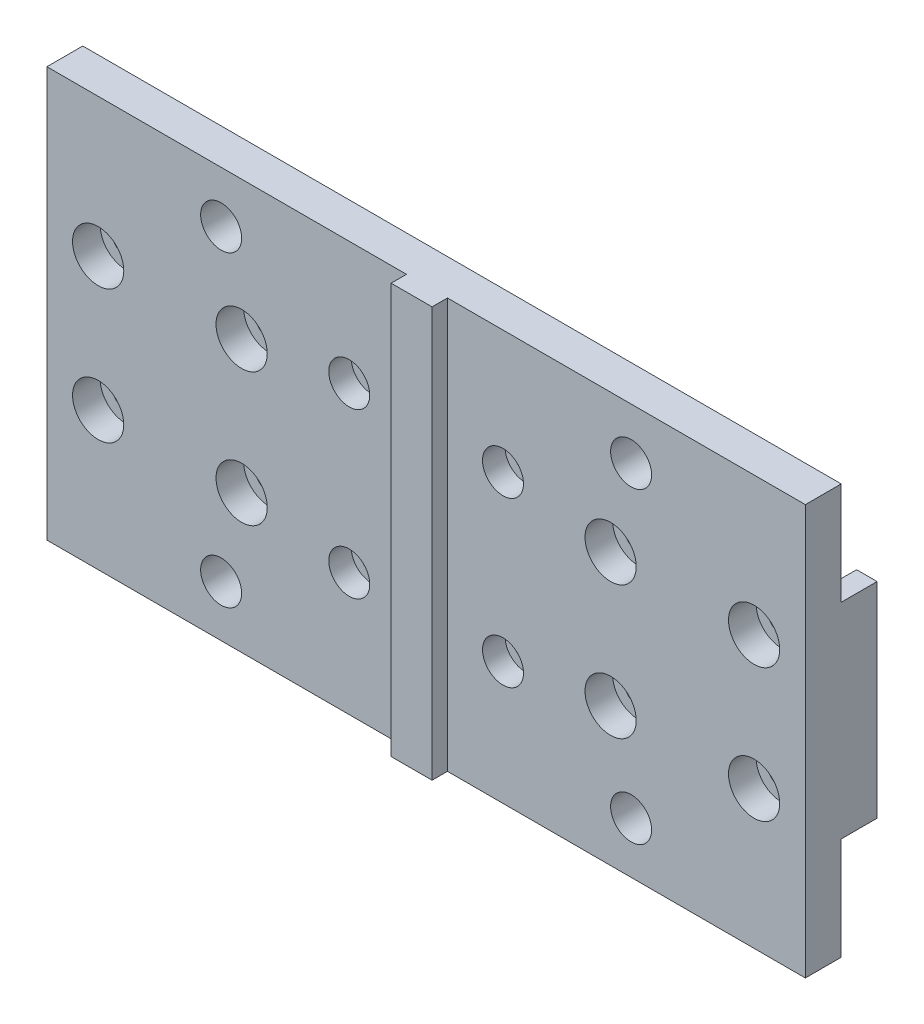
ISO-10303-21;
HEADER;
FILE_DESCRIPTION(('STEP AP214'),'2;1');
FILE_NAME('part.step','',(''),(''),'','','');
FILE_SCHEMA(('AUTOMOTIVE_DESIGN { 1 0 10303 214 1 1 1 1 }'));
ENDSEC;
DATA;
#1=APPLICATION_CONTEXT('core data for automotive mechanical design processes');
#2=APPLICATION_PROTOCOL_DEFINITION('international standard','automotive_design',2000,#1);
#3=PRODUCT_CONTEXT('',#1,'mechanical');
#4=PRODUCT('Part','Part','',(#3));
#5=PRODUCT_RELATED_PRODUCT_CATEGORY('part','',(#4));
#6=PRODUCT_DEFINITION_FORMATION('','',#4);
#7=PRODUCT_DEFINITION_CONTEXT('part definition',#1,'design');
#8=PRODUCT_DEFINITION('design','',#6,#7);
#9=PRODUCT_DEFINITION_SHAPE('','',#8);
#10=(LENGTH_UNIT() NAMED_UNIT(*) SI_UNIT(.MILLI.,.METRE.));
#11=(NAMED_UNIT(*) PLANE_ANGLE_UNIT() SI_UNIT($,.RADIAN.));
#12=(NAMED_UNIT(*) SI_UNIT($,.STERADIAN.) SOLID_ANGLE_UNIT());
#13=UNCERTAINTY_MEASURE_WITH_UNIT(LENGTH_MEASURE(1.E-05),#10,'distance_accuracy_value','');
#14=(GEOMETRIC_REPRESENTATION_CONTEXT(3) GLOBAL_UNCERTAINTY_ASSIGNED_CONTEXT((#13)) GLOBAL_UNIT_ASSIGNED_CONTEXT((#10,
#11,#12)) REPRESENTATION_CONTEXT('',''));
#15=CARTESIAN_POINT('',(0.,0.,0.));
#16=DIRECTION('',(0.,0.,1.));
#17=DIRECTION('',(1.,0.,0.));
#18=AXIS2_PLACEMENT_3D('',#15,#16,#17);
#19=CARTESIAN_POINT('',(0.,0.,7.));
#20=DIRECTION('',(0.,0.,1.));
#21=DIRECTION('',(1.,0.,0.));
#22=AXIS2_PLACEMENT_3D('',#19,#20,#21);
#23=PLANE('',#22);
#24=DIRECTION('',(0.,-1.,0.));
#25=VECTOR('',#24,1.);
#26=CARTESIAN_POINT('',(-3.83637478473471,26.392373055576,7.));
#27=LINE('',#26,#25);
#28=CARTESIAN_POINT('',(-3.83637478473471,26.392373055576,7.));
#29=VERTEX_POINT('',#28);
#30=CARTESIAN_POINT('',(-3.83637478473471,-53.607626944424,7.));
#31=VERTEX_POINT('',#30);
#32=EDGE_CURVE('E52',#29,#31,#27,.T.);
#33=ORIENTED_EDGE('',*,*,#32,.F.);
#34=DIRECTION('',(-1.,0.,0.));
#35=VECTOR('',#34,1.);
#36=CARTESIAN_POINT('',(-74.,26.392373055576,7.));
#37=LINE('',#36,#35);
#38=CARTESIAN_POINT('',(-74.,26.392373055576,7.));
#39=VERTEX_POINT('',#38);
#40=EDGE_CURVE('E244',#29,#39,#37,.T.);
#41=ORIENTED_EDGE('',*,*,#40,.T.);
#42=DIRECTION('',(0.,-1.,0.));
#43=VECTOR('',#42,1.);
#44=CARTESIAN_POINT('',(-74.,26.392373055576,7.));
#45=LINE('',#44,#43);
#46=CARTESIAN_POINT('',(-74.,-53.607626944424,7.));
#47=VERTEX_POINT('',#46);
#48=EDGE_CURVE('E278',#39,#47,#45,.T.);
#49=ORIENTED_EDGE('',*,*,#48,.T.);
#50=DIRECTION('',(1.,0.,0.));
#51=VECTOR('',#50,1.);
#52=CARTESIAN_POINT('',(-74.,-53.607626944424,7.));
#53=LINE('',#52,#51);
#54=EDGE_CURVE('E265',#47,#31,#53,.T.);
#55=ORIENTED_EDGE('',*,*,#54,.T.);
#56=EDGE_LOOP('',(#33,#41,#49,#55));
#57=FACE_BOUND('',#56,.T.);
#58=CARTESIAN_POINT('',(-15.,-29.607626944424,7.));
#59=DIRECTION('',(0.,0.,1.));
#60=DIRECTION('',(1.,0.,0.));
#61=AXIS2_PLACEMENT_3D('',#58,#59,#60);
#62=CIRCLE('',#61,4.);
#63=CARTESIAN_POINT('',(-11.,-29.607626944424,7.));
#64=VERTEX_POINT('',#63);
#65=EDGE_CURVE('E544',#64,#64,#62,.T.);
#66=ORIENTED_EDGE('',*,*,#65,.F.);
#67=EDGE_LOOP('',(#66));
#68=FACE_BOUND('',#67,.T.);
#69=CARTESIAN_POINT('',(-15.,2.39237305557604,7.));
#70=DIRECTION('',(0.,0.,1.));
#71=DIRECTION('',(1.,0.,0.));
#72=AXIS2_PLACEMENT_3D('',#69,#70,#71);
#73=CIRCLE('',#72,4.);
#74=CARTESIAN_POINT('',(-11.,2.39237305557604,7.));
#75=VERTEX_POINT('',#74);
#76=EDGE_CURVE('E517',#75,#75,#73,.T.);
#77=ORIENTED_EDGE('',*,*,#76,.F.);
#78=EDGE_LOOP('',(#77));
#79=FACE_BOUND('',#78,.T.);
#80=CARTESIAN_POINT('',(-64.,-26.607626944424,7.));
#81=DIRECTION('',(0.,0.,1.));
#82=DIRECTION('',(1.,0.,0.));
#83=AXIS2_PLACEMENT_3D('',#80,#81,#82);
#84=CIRCLE('',#83,5.);
#85=CARTESIAN_POINT('',(-59.,-26.607626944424,7.));
#86=VERTEX_POINT('',#85);
#87=EDGE_CURVE('E472',#86,#86,#84,.T.);
#88=ORIENTED_EDGE('',*,*,#87,.F.);
#89=EDGE_LOOP('',(#88));
#90=FACE_BOUND('',#89,.T.);
#91=CARTESIAN_POINT('',(-36.,-26.607626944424,7.));
#92=DIRECTION('',(0.,0.,1.));
#93=DIRECTION('',(1.,0.,0.));
#94=AXIS2_PLACEMENT_3D('',#91,#92,#93);
#95=CIRCLE('',#94,5.);
#96=CARTESIAN_POINT('',(-31.,-26.607626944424,7.));
#97=VERTEX_POINT('',#96);
#98=EDGE_CURVE('E463',#97,#97,#95,.T.);
#99=ORIENTED_EDGE('',*,*,#98,.F.);
#100=EDGE_LOOP('',(#99));
#101=FACE_BOUND('',#100,.T.);
#102=CARTESIAN_POINT('',(-36.,-0.60762694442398,7.));
#103=DIRECTION('',(0.,0.,1.));
#104=DIRECTION('',(1.,0.,0.));
#105=AXIS2_PLACEMENT_3D('',#102,#103,#104);
#106=CIRCLE('',#105,5.);
#107=CARTESIAN_POINT('',(-31.,-0.60762694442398,7.));
#108=VERTEX_POINT('',#107);
#109=EDGE_CURVE('E454',#108,#108,#106,.T.);
#110=ORIENTED_EDGE('',*,*,#109,.F.);
#111=EDGE_LOOP('',(#110));
#112=FACE_BOUND('',#111,.T.);
#113=CARTESIAN_POINT('',(-64.,-0.60762694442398,7.));
#114=DIRECTION('',(0.,0.,1.));
#115=DIRECTION('',(1.,0.,0.));
#116=AXIS2_PLACEMENT_3D('',#113,#114,#115);
#117=CIRCLE('',#116,5.);
#118=CARTESIAN_POINT('',(-59.,-0.60762694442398,7.));
#119=VERTEX_POINT('',#118);
#120=EDGE_CURVE('E445',#119,#119,#117,.T.);
#121=ORIENTED_EDGE('',*,*,#120,.F.);
#122=EDGE_LOOP('',(#121));
#123=FACE_BOUND('',#122,.T.);
#124=CARTESIAN_POINT('',(-40.,-43.607626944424,7.));
#125=DIRECTION('',(0.,0.,-1.));
#126=DIRECTION('',(-1.,0.,0.));
#127=AXIS2_PLACEMENT_3D('',#124,#125,#126);
#128=CIRCLE('',#127,4.00000000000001);
#129=CARTESIAN_POINT('',(-44.,-43.607626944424,7.));
#130=VERTEX_POINT('',#129);
#131=EDGE_CURVE('E442',#130,#130,#128,.T.);
#132=ORIENTED_EDGE('',*,*,#131,.T.);
#133=EDGE_LOOP('',(#132));
#134=FACE_BOUND('',#133,.T.);
#135=CARTESIAN_POINT('',(-40.,16.392373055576,7.));
#136=DIRECTION('',(0.,0.,-1.));
#137=DIRECTION('',(-1.,0.,0.));
#138=AXIS2_PLACEMENT_3D('',#135,#136,#137);
#139=CIRCLE('',#138,4.00000000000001);
#140=CARTESIAN_POINT('',(-44.,16.392373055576,7.));
#141=VERTEX_POINT('',#140);
#142=EDGE_CURVE('E439',#141,#141,#139,.T.);
#143=ORIENTED_EDGE('',*,*,#142,.T.);
#144=EDGE_LOOP('',(#143));
#145=FACE_BOUND('',#144,.T.);
#146=ADVANCED_FACE('F35',(#57,#68,#79,#90,#101,#112,#123,#134,#145),#23,.T.);
#147=CARTESIAN_POINT('',(0.,0.,-4.));
#148=DIRECTION('',(0.,0.,-1.));
#149=DIRECTION('',(-1.,0.,0.));
#150=AXIS2_PLACEMENT_3D('',#147,#148,#149);
#151=PLANE('',#150);
#152=CARTESIAN_POINT('',(-64.,-26.607626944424,-4.));
#153=DIRECTION('',(0.,0.,-1.));
#154=DIRECTION('',(-1.,0.,0.));
#155=AXIS2_PLACEMENT_3D('',#152,#153,#154);
#156=CIRCLE('',#155,2.74999999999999);
#157=CARTESIAN_POINT('',(-66.75,-26.607626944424,-4.));
#158=VERTEX_POINT('',#157);
#159=EDGE_CURVE('E355',#158,#158,#156,.T.);
#160=ORIENTED_EDGE('',*,*,#159,.F.);
#161=EDGE_LOOP('',(#160));
#162=FACE_BOUND('',#161,.T.);
#163=CARTESIAN_POINT('',(-64.,-0.60762694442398,-4.));
#164=DIRECTION('',(0.,0.,-1.));
#165=DIRECTION('',(-1.,0.,0.));
#166=AXIS2_PLACEMENT_3D('',#163,#164,#165);
#167=CIRCLE('',#166,2.74999999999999);
#168=CARTESIAN_POINT('',(-66.75,-0.60762694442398,-4.));
#169=VERTEX_POINT('',#168);
#170=EDGE_CURVE('E375',#169,#169,#167,.T.);
#171=ORIENTED_EDGE('',*,*,#170,.F.);
#172=EDGE_LOOP('',(#171));
#173=FACE_BOUND('',#172,.T.);
#174=CARTESIAN_POINT('',(-36.,-0.60762694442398,-4.));
#175=DIRECTION('',(0.,0.,-1.));
#176=DIRECTION('',(-1.,0.,0.));
#177=AXIS2_PLACEMENT_3D('',#174,#175,#176);
#178=CIRCLE('',#177,2.74999999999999);
#179=CARTESIAN_POINT('',(-38.75,-0.60762694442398,-4.));
#180=VERTEX_POINT('',#179);
#181=EDGE_CURVE('E379',#180,#180,#178,.T.);
#182=ORIENTED_EDGE('',*,*,#181,.F.);
#183=EDGE_LOOP('',(#182));
#184=FACE_BOUND('',#183,.T.);
#185=CARTESIAN_POINT('',(-36.,-26.607626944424,-4.));
#186=DIRECTION('',(0.,0.,-1.));
#187=DIRECTION('',(-1.,0.,0.));
#188=AXIS2_PLACEMENT_3D('',#185,#186,#187);
#189=CIRCLE('',#188,2.74999999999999);
#190=CARTESIAN_POINT('',(-38.75,-26.607626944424,-4.));
#191=VERTEX_POINT('',#190);
#192=EDGE_CURVE('E371',#191,#191,#189,.T.);
#193=ORIENTED_EDGE('',*,*,#192,.F.);
#194=EDGE_LOOP('',(#193));
#195=FACE_BOUND('',#194,.T.);
#196=DIRECTION('',(-1.,0.,0.));
#197=VECTOR('',#196,1.);
#198=CARTESIAN_POINT('',(74.,-33.607626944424,-4.));
#199=LINE('',#198,#197);
#200=CARTESIAN_POINT('',(-30.,-33.607626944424,-4.));
#201=VERTEX_POINT('',#200);
#202=CARTESIAN_POINT('',(-70.,-33.607626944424,-4.));
#203=VERTEX_POINT('',#202);
#204=EDGE_CURVE('E285',#201,#203,#199,.T.);
#205=ORIENTED_EDGE('',*,*,#204,.T.);
#206=DIRECTION('',(0.,-1.,0.));
#207=VECTOR('',#206,1.);
#208=CARTESIAN_POINT('',(-70.,6.39237305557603,-4.));
#209=LINE('',#208,#207);
#210=CARTESIAN_POINT('',(-70.,6.39237305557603,-4.));
#211=VERTEX_POINT('',#210);
#212=EDGE_CURVE('E220',#211,#203,#209,.T.);
#213=ORIENTED_EDGE('',*,*,#212,.F.);
#214=DIRECTION('',(1.,0.,0.));
#215=VECTOR('',#214,1.);
#216=CARTESIAN_POINT('',(74.,6.39237305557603,-4.));
#217=LINE('',#216,#215);
#218=CARTESIAN_POINT('',(-30.,6.39237305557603,-4.));
#219=VERTEX_POINT('',#218);
#220=EDGE_CURVE('E280',#211,#219,#217,.T.);
#221=ORIENTED_EDGE('',*,*,#220,.T.);
#222=DIRECTION('',(0.,1.,0.));
#223=VECTOR('',#222,1.);
#224=CARTESIAN_POINT('',(-30.,6.39237305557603,-4.));
#225=LINE('',#224,#223);
#226=EDGE_CURVE('E1343',#201,#219,#225,.T.);
#227=ORIENTED_EDGE('',*,*,#226,.F.);
#228=EDGE_LOOP('',(#205,#213,#221,#227));
#229=FACE_BOUND('',#228,.T.);
#230=ADVANCED_FACE('F642',(#162,#173,#184,#195,#229),#151,.T.);
#231=CARTESIAN_POINT('',(15.,-29.607626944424,-4.));
#232=DIRECTION('',(0.,0.,-1.));
#233=DIRECTION('',(-1.,0.,0.));
#234=AXIS2_PLACEMENT_3D('',#231,#232,#233);
#235=CIRCLE('',#234,2.25);
#236=CARTESIAN_POINT('',(12.75,-29.607626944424,-4.));
#237=VERTEX_POINT('',#236);
#238=EDGE_CURVE('E387',#237,#237,#235,.T.);
#239=ORIENTED_EDGE('',*,*,#238,.F.);
#240=EDGE_LOOP('',(#239));
#241=FACE_BOUND('',#240,.T.);
#242=CARTESIAN_POINT('',(15.,2.39237305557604,-4.));
#243=DIRECTION('',(0.,0.,-1.));
#244=DIRECTION('',(-1.,0.,0.));
#245=AXIS2_PLACEMENT_3D('',#242,#243,#244);
#246=CIRCLE('',#245,2.25);
#247=CARTESIAN_POINT('',(12.75,2.39237305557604,-4.));
#248=VERTEX_POINT('',#247);
#249=EDGE_CURVE('E393',#248,#248,#246,.T.);
#250=ORIENTED_EDGE('',*,*,#249,.F.);
#251=EDGE_LOOP('',(#250));
#252=FACE_BOUND('',#251,.T.);
#253=CARTESIAN_POINT('',(-15.,2.39237305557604,-4.));
#254=DIRECTION('',(0.,0.,-1.));
#255=DIRECTION('',(-1.,0.,0.));
#256=AXIS2_PLACEMENT_3D('',#253,#254,#255);
#257=CIRCLE('',#256,2.25);
#258=CARTESIAN_POINT('',(-17.25,2.39237305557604,-4.));
#259=VERTEX_POINT('',#258);
#260=EDGE_CURVE('E390',#259,#259,#257,.T.);
#261=ORIENTED_EDGE('',*,*,#260,.F.);
#262=EDGE_LOOP('',(#261));
#263=FACE_BOUND('',#262,.T.);
#264=CARTESIAN_POINT('',(-15.,-29.607626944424,-4.));
#265=DIRECTION('',(0.,0.,-1.));
#266=DIRECTION('',(-1.,0.,0.));
#267=AXIS2_PLACEMENT_3D('',#264,#265,#266);
#268=CIRCLE('',#267,2.25);
#269=CARTESIAN_POINT('',(-17.25,-29.607626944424,-4.));
#270=VERTEX_POINT('',#269);
#271=EDGE_CURVE('E384',#270,#270,#268,.T.);
#272=ORIENTED_EDGE('',*,*,#271,.F.);
#273=EDGE_LOOP('',(#272));
#274=FACE_BOUND('',#273,.T.);
#275=CARTESIAN_POINT('',(20.,-33.607626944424,-4.));
#276=VERTEX_POINT('',#275);
#277=CARTESIAN_POINT('',(-20.,-33.607626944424,-4.));
#278=VERTEX_POINT('',#277);
#279=EDGE_CURVE('E303',#276,#278,#199,.T.);
#280=ORIENTED_EDGE('',*,*,#279,.T.);
#281=DIRECTION('',(0.,-1.,0.));
#282=VECTOR('',#281,1.);
#283=CARTESIAN_POINT('',(-20.,6.39237305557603,-4.));
#284=LINE('',#283,#282);
#285=CARTESIAN_POINT('',(-20.,6.39237305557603,-4.));
#286=VERTEX_POINT('',#285);
#287=EDGE_CURVE('E311',#286,#278,#284,.T.);
#288=ORIENTED_EDGE('',*,*,#287,.F.);
#289=CARTESIAN_POINT('',(20.,6.39237305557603,-4.));
#290=VERTEX_POINT('',#289);
#291=EDGE_CURVE('E284',#286,#290,#217,.T.);
#292=ORIENTED_EDGE('',*,*,#291,.T.);
#293=DIRECTION('',(0.,1.,0.));
#294=VECTOR('',#293,1.);
#295=CARTESIAN_POINT('',(20.,6.39237305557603,-4.));
#296=LINE('',#295,#294);
#297=EDGE_CURVE('E308',#276,#290,#296,.T.);
#298=ORIENTED_EDGE('',*,*,#297,.F.);
#299=EDGE_LOOP('',(#280,#288,#292,#298));
#300=FACE_BOUND('',#299,.T.);
#301=ADVANCED_FACE('F307',(#241,#252,#263,#274,#300),#151,.T.);
#302=CARTESIAN_POINT('',(36.,-26.607626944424,-4.));
#303=DIRECTION('',(0.,0.,-1.));
#304=DIRECTION('',(-1.,0.,0.));
#305=AXIS2_PLACEMENT_3D('',#302,#303,#304);
#306=CIRCLE('',#305,2.74999999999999);
#307=CARTESIAN_POINT('',(33.25,-26.607626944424,-4.));
#308=VERTEX_POINT('',#307);
#309=EDGE_CURVE('E396',#308,#308,#306,.T.);
#310=ORIENTED_EDGE('',*,*,#309,.F.);
#311=EDGE_LOOP('',(#310));
#312=FACE_BOUND('',#311,.T.);
#313=CARTESIAN_POINT('',(64.,-26.607626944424,-4.));
#314=DIRECTION('',(0.,0.,-1.));
#315=DIRECTION('',(-1.,0.,0.));
#316=AXIS2_PLACEMENT_3D('',#313,#314,#315);
#317=CIRCLE('',#316,2.75);
#318=CARTESIAN_POINT('',(61.25,-26.607626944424,-4.));
#319=VERTEX_POINT('',#318);
#320=EDGE_CURVE('E402',#319,#319,#317,.T.);
#321=ORIENTED_EDGE('',*,*,#320,.F.);
#322=EDGE_LOOP('',(#321));
#323=FACE_BOUND('',#322,.T.);
#324=CARTESIAN_POINT('',(64.,-0.60762694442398,-4.));
#325=DIRECTION('',(0.,0.,-1.));
#326=DIRECTION('',(-1.,0.,0.));
#327=AXIS2_PLACEMENT_3D('',#324,#325,#326);
#328=CIRCLE('',#327,2.75);
#329=CARTESIAN_POINT('',(61.25,-0.60762694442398,-4.));
#330=VERTEX_POINT('',#329);
#331=EDGE_CURVE('E404',#330,#330,#328,.T.);
#332=ORIENTED_EDGE('',*,*,#331,.F.);
#333=EDGE_LOOP('',(#332));
#334=FACE_BOUND('',#333,.T.);
#335=CARTESIAN_POINT('',(36.,-0.60762694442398,-4.));
#336=DIRECTION('',(0.,0.,-1.));
#337=DIRECTION('',(-1.,0.,0.));
#338=AXIS2_PLACEMENT_3D('',#335,#336,#337);
#339=CIRCLE('',#338,2.74999999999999);
#340=CARTESIAN_POINT('',(33.25,-0.60762694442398,-4.));
#341=VERTEX_POINT('',#340);
#342=EDGE_CURVE('E399',#341,#341,#339,.T.);
#343=ORIENTED_EDGE('',*,*,#342,.F.);
#344=EDGE_LOOP('',(#343));
#345=FACE_BOUND('',#344,.T.);
#346=CARTESIAN_POINT('',(70.,-33.607626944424,-4.));
#347=VERTEX_POINT('',#346);
#348=CARTESIAN_POINT('',(30.,-33.607626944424,-4.));
#349=VERTEX_POINT('',#348);
#350=EDGE_CURVE('E300',#347,#349,#199,.T.);
#351=ORIENTED_EDGE('',*,*,#350,.T.);
#352=DIRECTION('',(0.,-1.,0.));
#353=VECTOR('',#352,1.);
#354=CARTESIAN_POINT('',(30.,6.39237305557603,-4.));
#355=LINE('',#354,#353);
#356=CARTESIAN_POINT('',(30.,6.39237305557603,-4.));
#357=VERTEX_POINT('',#356);
#358=EDGE_CURVE('E326',#357,#349,#355,.T.);
#359=ORIENTED_EDGE('',*,*,#358,.F.);
#360=CARTESIAN_POINT('',(70.,6.39237305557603,-4.));
#361=VERTEX_POINT('',#360);
#362=EDGE_CURVE('E297',#357,#361,#217,.T.);
#363=ORIENTED_EDGE('',*,*,#362,.T.);
#364=DIRECTION('',(0.,1.,0.));
#365=VECTOR('',#364,1.);
#366=CARTESIAN_POINT('',(70.,6.39237305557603,-4.));
#367=LINE('',#366,#365);
#368=EDGE_CURVE('E341',#347,#361,#367,.T.);
#369=ORIENTED_EDGE('',*,*,#368,.F.);
#370=EDGE_LOOP('',(#351,#359,#363,#369));
#371=FACE_BOUND('',#370,.T.);
#372=ADVANCED_FACE('F650',(#312,#323,#334,#345,#371),#151,.T.);
#373=CARTESIAN_POINT('',(-74.,-53.607626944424,0.));
#374=DIRECTION('',(0.,0.,1.));
#375=DIRECTION('',(1.,0.,0.));
#376=AXIS2_PLACEMENT_3D('',#373,#374,#375);
#377=PLANE('',#376);
#378=CARTESIAN_POINT('',(-40.,16.392373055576,0.));
#379=DIRECTION('',(0.,0.,1.));
#380=DIRECTION('',(1.,0.,0.));
#381=AXIS2_PLACEMENT_3D('',#378,#379,#380);
#382=CIRCLE('',#381,4.00000000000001);
#383=CARTESIAN_POINT('',(-36.,16.392373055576,0.));
#384=VERTEX_POINT('',#383);
#385=EDGE_CURVE('E584',#384,#384,#382,.T.);
#386=ORIENTED_EDGE('',*,*,#385,.T.);
#387=EDGE_LOOP('',(#386));
#388=FACE_BOUND('',#387,.T.);
#389=CARTESIAN_POINT('',(40.,16.392373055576,0.));
#390=DIRECTION('',(0.,0.,1.));
#391=DIRECTION('',(1.,0.,0.));
#392=AXIS2_PLACEMENT_3D('',#389,#390,#391);
#393=CIRCLE('',#392,4.00000000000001);
#394=CARTESIAN_POINT('',(44.,16.392373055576,0.));
#395=VERTEX_POINT('',#394);
#396=EDGE_CURVE('E590',#395,#395,#393,.T.);
#397=ORIENTED_EDGE('',*,*,#396,.T.);
#398=EDGE_LOOP('',(#397));
#399=FACE_BOUND('',#398,.T.);
#400=DIRECTION('',(1.,0.,0.));
#401=VECTOR('',#400,1.);
#402=CARTESIAN_POINT('',(74.,6.39237305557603,0.));
#403=LINE('',#402,#401);
#404=CARTESIAN_POINT('',(-74.,6.39237305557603,0.));
#405=VERTEX_POINT('',#404);
#406=CARTESIAN_POINT('',(74.,6.39237305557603,0.));
#407=VERTEX_POINT('',#406);
#408=EDGE_CURVE('E410',#405,#407,#403,.T.);
#409=ORIENTED_EDGE('',*,*,#408,.F.);
#410=DIRECTION('',(0.,-1.,0.));
#411=VECTOR('',#410,1.);
#412=CARTESIAN_POINT('',(-74.,26.392373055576,0.));
#413=LINE('',#412,#411);
#414=CARTESIAN_POINT('',(-74.,26.392373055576,0.));
#415=VERTEX_POINT('',#414);
#416=EDGE_CURVE('E563',#415,#405,#413,.T.);
#417=ORIENTED_EDGE('',*,*,#416,.F.);
#418=DIRECTION('',(-1.,0.,0.));
#419=VECTOR('',#418,1.);
#420=CARTESIAN_POINT('',(-74.,26.392373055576,0.));
#421=LINE('',#420,#419);
#422=CARTESIAN_POINT('',(74.,26.392373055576,0.));
#423=VERTEX_POINT('',#422);
#424=EDGE_CURVE('E572',#423,#415,#421,.T.);
#425=ORIENTED_EDGE('',*,*,#424,.F.);
#426=DIRECTION('',(0.,1.,0.));
#427=VECTOR('',#426,1.);
#428=CARTESIAN_POINT('',(74.,26.392373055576,0.));
#429=LINE('',#428,#427);
#430=EDGE_CURVE('E418',#407,#423,#429,.T.);
#431=ORIENTED_EDGE('',*,*,#430,.F.);
#432=EDGE_LOOP('',(#409,#417,#425,#431));
#433=FACE_BOUND('',#432,.T.);
#434=ADVANCED_FACE('F665',(#388,#399,#433),#377,.F.);
#435=CARTESIAN_POINT('',(-40.,-43.607626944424,0.));
#436=DIRECTION('',(0.,0.,1.));
#437=DIRECTION('',(1.,0.,0.));
#438=AXIS2_PLACEMENT_3D('',#435,#436,#437);
#439=CIRCLE('',#438,4.00000000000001);
#440=CARTESIAN_POINT('',(-36.,-43.607626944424,0.));
#441=VERTEX_POINT('',#440);
#442=EDGE_CURVE('E588',#441,#441,#439,.T.);
#443=ORIENTED_EDGE('',*,*,#442,.T.);
#444=EDGE_LOOP('',(#443));
#445=FACE_BOUND('',#444,.T.);
#446=CARTESIAN_POINT('',(40.,-43.607626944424,0.));
#447=DIRECTION('',(0.,0.,1.));
#448=DIRECTION('',(1.,0.,0.));
#449=AXIS2_PLACEMENT_3D('',#446,#447,#448);
#450=CIRCLE('',#449,4.00000000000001);
#451=CARTESIAN_POINT('',(44.,-43.607626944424,0.));
#452=VERTEX_POINT('',#451);
#453=EDGE_CURVE('E263',#452,#452,#450,.T.);
#454=ORIENTED_EDGE('',*,*,#453,.T.);
#455=EDGE_LOOP('',(#454));
#456=FACE_BOUND('',#455,.T.);
#457=DIRECTION('',(-1.,0.,0.));
#458=VECTOR('',#457,1.);
#459=CARTESIAN_POINT('',(74.,-33.607626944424,0.));
#460=LINE('',#459,#458);
#461=CARTESIAN_POINT('',(74.,-33.607626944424,0.));
#462=VERTEX_POINT('',#461);
#463=CARTESIAN_POINT('',(-74.,-33.607626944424,0.));
#464=VERTEX_POINT('',#463);
#465=EDGE_CURVE('E406',#462,#464,#460,.T.);
#466=ORIENTED_EDGE('',*,*,#465,.F.);
#467=CARTESIAN_POINT('',(74.,-53.607626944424,0.));
#468=VERTEX_POINT('',#467);
#469=EDGE_CURVE('E568',#468,#462,#429,.T.);
#470=ORIENTED_EDGE('',*,*,#469,.F.);
#471=DIRECTION('',(1.,0.,0.));
#472=VECTOR('',#471,1.);
#473=CARTESIAN_POINT('',(-74.,-53.607626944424,0.));
#474=LINE('',#473,#472);
#475=CARTESIAN_POINT('',(-74.,-53.607626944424,0.));
#476=VERTEX_POINT('',#475);
#477=EDGE_CURVE('E559',#476,#468,#474,.T.);
#478=ORIENTED_EDGE('',*,*,#477,.F.);
#479=EDGE_CURVE('E556',#464,#476,#413,.T.);
#480=ORIENTED_EDGE('',*,*,#479,.F.);
#481=EDGE_LOOP('',(#466,#470,#478,#480));
#482=FACE_BOUND('',#481,.T.);
#483=ADVANCED_FACE('F571',(#445,#456,#482),#377,.F.);
#484=CARTESIAN_POINT('',(-74.,26.392373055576,4.));
#485=DIRECTION('',(1.,0.,0.));
#486=DIRECTION('',(0.,0.,-1.));
#487=AXIS2_PLACEMENT_3D('',#484,#485,#486);
#488=PLANE('',#487);
#489=ORIENTED_EDGE('',*,*,#416,.T.);
#490=DIRECTION('',(0.,0.,1.));
#491=VECTOR('',#490,1.);
#492=CARTESIAN_POINT('',(-74.,6.39237305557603,-4.));
#493=LINE('',#492,#491);
#494=CARTESIAN_POINT('',(-74.,6.39237305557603,-7.));
#495=VERTEX_POINT('',#494);
#496=EDGE_CURVE('E424',#495,#405,#493,.T.);
#497=ORIENTED_EDGE('',*,*,#496,.F.);
#498=DIRECTION('',(0.,1.,0.));
#499=VECTOR('',#498,1.);
#500=CARTESIAN_POINT('',(-74.,6.39237305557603,-7.));
#501=LINE('',#500,#499);
#502=CARTESIAN_POINT('',(-74.,-33.607626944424,-7.));
#503=VERTEX_POINT('',#502);
#504=EDGE_CURVE('E1391',#503,#495,#501,.T.);
#505=ORIENTED_EDGE('',*,*,#504,.F.);
#506=DIRECTION('',(0.,0.,1.));
#507=VECTOR('',#506,1.);
#508=CARTESIAN_POINT('',(-74.,-33.607626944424,-4.));
#509=LINE('',#508,#507);
#510=EDGE_CURVE('E421',#503,#464,#509,.T.);
#511=ORIENTED_EDGE('',*,*,#510,.T.);
#512=ORIENTED_EDGE('',*,*,#479,.T.);
#513=DIRECTION('',(0.,0.,-1.));
#514=VECTOR('',#513,1.);
#515=CARTESIAN_POINT('',(-74.,-53.607626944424,4.));
#516=LINE('',#515,#514);
#517=EDGE_CURVE('E11',#47,#476,#516,.T.);
#518=ORIENTED_EDGE('',*,*,#517,.F.);
#519=ORIENTED_EDGE('',*,*,#48,.F.);
#520=DIRECTION('',(0.,0.,-1.));
#521=VECTOR('',#520,1.);
#522=CARTESIAN_POINT('',(-74.,26.392373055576,4.));
#523=LINE('',#522,#521);
#524=EDGE_CURVE('E258',#39,#415,#523,.T.);
#525=ORIENTED_EDGE('',*,*,#524,.T.);
#526=EDGE_LOOP('',(#489,#497,#505,#511,#512,#518,#519,#525));
#527=FACE_BOUND('',#526,.T.);
#528=ADVANCED_FACE('F37',(#527),#488,.F.);
#529=CARTESIAN_POINT('',(-74.,-53.607626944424,4.));
#530=DIRECTION('',(0.,1.,0.));
#531=DIRECTION('',(-1.,0.,0.));
#532=AXIS2_PLACEMENT_3D('',#529,#530,#531);
#533=PLANE('',#532);
#534=ORIENTED_EDGE('',*,*,#477,.T.);
#535=DIRECTION('',(0.,0.,-1.));
#536=VECTOR('',#535,1.);
#537=CARTESIAN_POINT('',(74.,-53.607626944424,4.));
#538=LINE('',#537,#536);
#539=CARTESIAN_POINT('',(74.,-53.607626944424,7.));
#540=VERTEX_POINT('',#539);
#541=EDGE_CURVE('E44',#540,#468,#538,.T.);
#542=ORIENTED_EDGE('',*,*,#541,.F.);
#543=CARTESIAN_POINT('',(4.16362521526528,-53.607626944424,7.));
#544=VERTEX_POINT('',#543);
#545=EDGE_CURVE('E268',#544,#540,#53,.T.);
#546=ORIENTED_EDGE('',*,*,#545,.F.);
#547=DIRECTION('',(0.,0.,-1.));
#548=VECTOR('',#547,1.);
#549=CARTESIAN_POINT('',(4.16362521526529,-53.607626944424,10.));
#550=LINE('',#549,#548);
#551=CARTESIAN_POINT('',(4.16362521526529,-53.607626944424,10.));
#552=VERTEX_POINT('',#551);
#553=EDGE_CURVE('E205',#552,#544,#550,.T.);
#554=ORIENTED_EDGE('',*,*,#553,.F.);
#555=DIRECTION('',(1.,0.,0.));
#556=VECTOR('',#555,1.);
#557=CARTESIAN_POINT('',(-3.83637478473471,-53.607626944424,10.));
#558=LINE('',#557,#556);
#559=CARTESIAN_POINT('',(-3.83637478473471,-53.607626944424,10.));
#560=VERTEX_POINT('',#559);
#561=EDGE_CURVE('E198',#560,#552,#558,.T.);
#562=ORIENTED_EDGE('',*,*,#561,.F.);
#563=DIRECTION('',(0.,0.,-1.));
#564=VECTOR('',#563,1.);
#565=CARTESIAN_POINT('',(-3.83637478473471,-53.607626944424,10.));
#566=LINE('',#565,#564);
#567=EDGE_CURVE('E203',#560,#31,#566,.T.);
#568=ORIENTED_EDGE('',*,*,#567,.T.);
#569=ORIENTED_EDGE('',*,*,#54,.F.);
#570=ORIENTED_EDGE('',*,*,#517,.T.);
#571=EDGE_LOOP('',(#534,#542,#546,#554,#562,#568,#569,#570));
#572=FACE_BOUND('',#571,.T.);
#573=ADVANCED_FACE('F200',(#572),#533,.F.);
#574=CARTESIAN_POINT('',(74.,26.392373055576,4.));
#575=DIRECTION('',(-1.,0.,0.));
#576=DIRECTION('',(0.,0.,1.));
#577=AXIS2_PLACEMENT_3D('',#574,#575,#576);
#578=PLANE('',#577);
#579=ORIENTED_EDGE('',*,*,#469,.T.);
#580=DIRECTION('',(0.,0.,1.));
#581=VECTOR('',#580,1.);
#582=CARTESIAN_POINT('',(74.,-33.607626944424,-4.));
#583=LINE('',#582,#581);
#584=CARTESIAN_POINT('',(74.,-33.607626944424,-7.));
#585=VERTEX_POINT('',#584);
#586=EDGE_CURVE('E423',#585,#462,#583,.T.);
#587=ORIENTED_EDGE('',*,*,#586,.F.);
#588=DIRECTION('',(0.,-1.,0.));
#589=VECTOR('',#588,1.);
#590=CARTESIAN_POINT('',(74.,6.39237305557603,-7.));
#591=LINE('',#590,#589);
#592=CARTESIAN_POINT('',(74.,6.39237305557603,-7.));
#593=VERTEX_POINT('',#592);
#594=EDGE_CURVE('E342',#593,#585,#591,.T.);
#595=ORIENTED_EDGE('',*,*,#594,.F.);
#596=DIRECTION('',(0.,0.,1.));
#597=VECTOR('',#596,1.);
#598=CARTESIAN_POINT('',(74.,6.39237305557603,-4.));
#599=LINE('',#598,#597);
#600=EDGE_CURVE('E283',#593,#407,#599,.T.);
#601=ORIENTED_EDGE('',*,*,#600,.T.);
#602=ORIENTED_EDGE('',*,*,#430,.T.);
#603=DIRECTION('',(0.,0.,-1.));
#604=VECTOR('',#603,1.);
#605=CARTESIAN_POINT('',(74.,26.392373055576,4.));
#606=LINE('',#605,#604);
#607=CARTESIAN_POINT('',(74.,26.392373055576,7.));
#608=VERTEX_POINT('',#607);
#609=EDGE_CURVE('E569',#608,#423,#606,.T.);
#610=ORIENTED_EDGE('',*,*,#609,.F.);
#611=DIRECTION('',(0.,1.,0.));
#612=VECTOR('',#611,1.);
#613=CARTESIAN_POINT('',(74.,26.392373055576,7.));
#614=LINE('',#613,#612);
#615=EDGE_CURVE('E262',#540,#608,#614,.T.);
#616=ORIENTED_EDGE('',*,*,#615,.F.);
#617=ORIENTED_EDGE('',*,*,#541,.T.);
#618=EDGE_LOOP('',(#579,#587,#595,#601,#602,#610,#616,#617));
#619=FACE_BOUND('',#618,.T.);
#620=ADVANCED_FACE('F567',(#619),#578,.F.);
#621=CARTESIAN_POINT('',(-74.,26.392373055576,4.));
#622=DIRECTION('',(0.,-1.,0.));
#623=DIRECTION('',(1.,0.,0.));
#624=AXIS2_PLACEMENT_3D('',#621,#622,#623);
#625=PLANE('',#624);
#626=ORIENTED_EDGE('',*,*,#424,.T.);
#627=ORIENTED_EDGE('',*,*,#524,.F.);
#628=ORIENTED_EDGE('',*,*,#40,.F.);
#629=DIRECTION('',(0.,0.,-1.));
#630=VECTOR('',#629,1.);
#631=CARTESIAN_POINT('',(-3.83637478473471,26.392373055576,10.));
#632=LINE('',#631,#630);
#633=CARTESIAN_POINT('',(-3.83637478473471,26.392373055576,10.));
#634=VERTEX_POINT('',#633);
#635=EDGE_CURVE('E233',#634,#29,#632,.T.);
#636=ORIENTED_EDGE('',*,*,#635,.F.);
#637=DIRECTION('',(-1.,0.,0.));
#638=VECTOR('',#637,1.);
#639=CARTESIAN_POINT('',(-3.83637478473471,26.392373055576,10.));
#640=LINE('',#639,#638);
#641=CARTESIAN_POINT('',(4.16362521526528,26.392373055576,10.));
#642=VERTEX_POINT('',#641);
#643=EDGE_CURVE('E214',#642,#634,#640,.T.);
#644=ORIENTED_EDGE('',*,*,#643,.F.);
#645=DIRECTION('',(0.,0.,-1.));
#646=VECTOR('',#645,1.);
#647=CARTESIAN_POINT('',(4.16362521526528,26.392373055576,10.));
#648=LINE('',#647,#646);
#649=CARTESIAN_POINT('',(4.16362521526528,26.392373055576,7.));
#650=VERTEX_POINT('',#649);
#651=EDGE_CURVE('E225',#642,#650,#648,.T.);
#652=ORIENTED_EDGE('',*,*,#651,.T.);
#653=EDGE_CURVE('E261',#608,#650,#37,.T.);
#654=ORIENTED_EDGE('',*,*,#653,.F.);
#655=ORIENTED_EDGE('',*,*,#609,.T.);
#656=EDGE_LOOP('',(#626,#627,#628,#636,#644,#652,#654,#655));
#657=FACE_BOUND('',#656,.T.);
#658=ADVANCED_FACE('F255',(#657),#625,.F.);
#659=CARTESIAN_POINT('',(-40.,16.392373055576,0.));
#660=DIRECTION('',(0.,0.,1.));
#661=DIRECTION('',(1.,0.,0.));
#662=AXIS2_PLACEMENT_3D('',#659,#660,#661);
#663=CYLINDRICAL_SURFACE('',#662,4.00000000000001);
#664=ORIENTED_EDGE('',*,*,#385,.F.);
#665=EDGE_LOOP('',(#664));
#666=FACE_BOUND('',#665,.T.);
#667=ORIENTED_EDGE('',*,*,#142,.F.);
#668=EDGE_LOOP('',(#667));
#669=FACE_BOUND('',#668,.T.);
#670=ADVANCED_FACE('F660',(#666,#669),#663,.F.);
#671=CARTESIAN_POINT('',(-40.,-43.607626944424,0.));
#672=DIRECTION('',(0.,0.,1.));
#673=DIRECTION('',(1.,0.,0.));
#674=AXIS2_PLACEMENT_3D('',#671,#672,#673);
#675=CYLINDRICAL_SURFACE('',#674,4.00000000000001);
#676=ORIENTED_EDGE('',*,*,#442,.F.);
#677=EDGE_LOOP('',(#676));
#678=FACE_BOUND('',#677,.T.);
#679=ORIENTED_EDGE('',*,*,#131,.F.);
#680=EDGE_LOOP('',(#679));
#681=FACE_BOUND('',#680,.T.);
#682=ADVANCED_FACE('F656',(#678,#681),#675,.F.);
#683=CARTESIAN_POINT('',(40.,16.392373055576,0.));
#684=DIRECTION('',(0.,0.,1.));
#685=DIRECTION('',(1.,0.,0.));
#686=AXIS2_PLACEMENT_3D('',#683,#684,#685);
#687=CYLINDRICAL_SURFACE('',#686,4.00000000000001);
#688=ORIENTED_EDGE('',*,*,#396,.F.);
#689=EDGE_LOOP('',(#688));
#690=FACE_BOUND('',#689,.T.);
#691=CARTESIAN_POINT('',(40.,16.392373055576,7.));
#692=DIRECTION('',(0.,0.,-1.));
#693=DIRECTION('',(-1.,0.,0.));
#694=AXIS2_PLACEMENT_3D('',#691,#692,#693);
#695=CIRCLE('',#694,4.00000000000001);
#696=CARTESIAN_POINT('',(36.,16.392373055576,7.));
#697=VERTEX_POINT('',#696);
#698=EDGE_CURVE('E436',#697,#697,#695,.T.);
#699=ORIENTED_EDGE('',*,*,#698,.F.);
#700=EDGE_LOOP('',(#699));
#701=FACE_BOUND('',#700,.T.);
#702=ADVANCED_FACE('F602',(#690,#701),#687,.F.);
#703=CARTESIAN_POINT('',(40.,-43.607626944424,0.));
#704=DIRECTION('',(0.,0.,1.));
#705=DIRECTION('',(1.,0.,0.));
#706=AXIS2_PLACEMENT_3D('',#703,#704,#705);
#707=CYLINDRICAL_SURFACE('',#706,4.00000000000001);
#708=ORIENTED_EDGE('',*,*,#453,.F.);
#709=EDGE_LOOP('',(#708));
#710=FACE_BOUND('',#709,.T.);
#711=CARTESIAN_POINT('',(40.,-43.607626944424,7.));
#712=DIRECTION('',(0.,0.,-1.));
#713=DIRECTION('',(-1.,0.,0.));
#714=AXIS2_PLACEMENT_3D('',#711,#712,#713);
#715=CIRCLE('',#714,4.00000000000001);
#716=CARTESIAN_POINT('',(36.,-43.607626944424,7.));
#717=VERTEX_POINT('',#716);
#718=EDGE_CURVE('E428',#717,#717,#715,.T.);
#719=ORIENTED_EDGE('',*,*,#718,.F.);
#720=EDGE_LOOP('',(#719));
#721=FACE_BOUND('',#720,.T.);
#722=ADVANCED_FACE('F598',(#710,#721),#707,.F.);
#723=DIRECTION('',(0.,1.,0.));
#724=VECTOR('',#723,1.);
#725=CARTESIAN_POINT('',(4.16362521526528,26.392373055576,7.));
#726=LINE('',#725,#724);
#727=EDGE_CURVE('E60',#544,#650,#726,.T.);
#728=ORIENTED_EDGE('',*,*,#727,.F.);
#729=ORIENTED_EDGE('',*,*,#545,.T.);
#730=ORIENTED_EDGE('',*,*,#615,.T.);
#731=ORIENTED_EDGE('',*,*,#653,.T.);
#732=EDGE_LOOP('',(#728,#729,#730,#731));
#733=FACE_BOUND('',#732,.T.);
#734=ORIENTED_EDGE('',*,*,#718,.T.);
#735=EDGE_LOOP('',(#734));
#736=FACE_BOUND('',#735,.T.);
#737=ORIENTED_EDGE('',*,*,#698,.T.);
#738=EDGE_LOOP('',(#737));
#739=FACE_BOUND('',#738,.T.);
#740=CARTESIAN_POINT('',(36.,-0.60762694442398,7.));
#741=DIRECTION('',(0.,0.,1.));
#742=DIRECTION('',(1.,0.,0.));
#743=AXIS2_PLACEMENT_3D('',#740,#741,#742);
#744=CIRCLE('',#743,5.);
#745=CARTESIAN_POINT('',(41.,-0.60762694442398,7.));
#746=VERTEX_POINT('',#745);
#747=EDGE_CURVE('E481',#746,#746,#744,.T.);
#748=ORIENTED_EDGE('',*,*,#747,.F.);
#749=EDGE_LOOP('',(#748));
#750=FACE_BOUND('',#749,.T.);
#751=CARTESIAN_POINT('',(64.,-0.60762694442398,7.));
#752=DIRECTION('',(0.,0.,1.));
#753=DIRECTION('',(1.,0.,0.));
#754=AXIS2_PLACEMENT_3D('',#751,#752,#753);
#755=CIRCLE('',#754,5.);
#756=CARTESIAN_POINT('',(69.,-0.60762694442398,7.));
#757=VERTEX_POINT('',#756);
#758=EDGE_CURVE('E490',#757,#757,#755,.T.);
#759=ORIENTED_EDGE('',*,*,#758,.F.);
#760=EDGE_LOOP('',(#759));
#761=FACE_BOUND('',#760,.T.);
#762=CARTESIAN_POINT('',(64.,-26.607626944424,7.));
#763=DIRECTION('',(0.,0.,1.));
#764=DIRECTION('',(1.,0.,0.));
#765=AXIS2_PLACEMENT_3D('',#762,#763,#764);
#766=CIRCLE('',#765,5.);
#767=CARTESIAN_POINT('',(69.,-26.607626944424,7.));
#768=VERTEX_POINT('',#767);
#769=EDGE_CURVE('E499',#768,#768,#766,.T.);
#770=ORIENTED_EDGE('',*,*,#769,.F.);
#771=EDGE_LOOP('',(#770));
#772=FACE_BOUND('',#771,.T.);
#773=CARTESIAN_POINT('',(36.,-26.607626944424,7.));
#774=DIRECTION('',(0.,0.,1.));
#775=DIRECTION('',(1.,0.,0.));
#776=AXIS2_PLACEMENT_3D('',#773,#774,#775);
#777=CIRCLE('',#776,5.);
#778=CARTESIAN_POINT('',(41.,-26.607626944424,7.));
#779=VERTEX_POINT('',#778);
#780=EDGE_CURVE('E508',#779,#779,#777,.T.);
#781=ORIENTED_EDGE('',*,*,#780,.F.);
#782=EDGE_LOOP('',(#781));
#783=FACE_BOUND('',#782,.T.);
#784=CARTESIAN_POINT('',(15.,2.39237305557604,7.));
#785=DIRECTION('',(0.,0.,1.));
#786=DIRECTION('',(1.,0.,0.));
#787=AXIS2_PLACEMENT_3D('',#784,#785,#786);
#788=CIRCLE('',#787,4.);
#789=CARTESIAN_POINT('',(19.,2.39237305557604,7.));
#790=VERTEX_POINT('',#789);
#791=EDGE_CURVE('E526',#790,#790,#788,.T.);
#792=ORIENTED_EDGE('',*,*,#791,.F.);
#793=EDGE_LOOP('',(#792));
#794=FACE_BOUND('',#793,.T.);
#795=CARTESIAN_POINT('',(15.,-29.607626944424,7.));
#796=DIRECTION('',(0.,0.,1.));
#797=DIRECTION('',(1.,0.,0.));
#798=AXIS2_PLACEMENT_3D('',#795,#796,#797);
#799=CIRCLE('',#798,4.);
#800=CARTESIAN_POINT('',(19.,-29.607626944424,7.));
#801=VERTEX_POINT('',#800);
#802=EDGE_CURVE('E535',#801,#801,#799,.T.);
#803=ORIENTED_EDGE('',*,*,#802,.F.);
#804=EDGE_LOOP('',(#803));
#805=FACE_BOUND('',#804,.T.);
#806=ADVANCED_FACE('F601',(#733,#736,#739,#750,#761,#772,#783,#794,#805),#23,.T.);
#807=CARTESIAN_POINT('',(-15.,-29.607626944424,7.));
#808=DIRECTION('',(0.,0.,1.));
#809=DIRECTION('',(1.,0.,0.));
#810=AXIS2_PLACEMENT_3D('',#807,#808,#809);
#811=CYLINDRICAL_SURFACE('',#810,2.25);
#812=CARTESIAN_POINT('',(-15.,-29.607626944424,2.6));
#813=DIRECTION('',(0.,0.,1.));
#814=DIRECTION('',(1.,0.,0.));
#815=AXIS2_PLACEMENT_3D('',#812,#813,#814);
#816=CIRCLE('',#815,2.25);
#817=CARTESIAN_POINT('',(-12.75,-29.607626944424,2.6));
#818=VERTEX_POINT('',#817);
#819=EDGE_CURVE('E550',#818,#818,#816,.T.);
#820=ORIENTED_EDGE('',*,*,#819,.T.);
#821=EDGE_LOOP('',(#820));
#822=FACE_BOUND('',#821,.T.);
#823=ORIENTED_EDGE('',*,*,#271,.T.);
#824=EDGE_LOOP('',(#823));
#825=FACE_BOUND('',#824,.T.);
#826=ADVANCED_FACE('F608',(#822,#825),#811,.F.);
#827=CARTESIAN_POINT('',(-12.75,-29.607626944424,2.6));
#828=DIRECTION('',(0.,0.,-1.));
#829=DIRECTION('',(-1.,0.,0.));
#830=AXIS2_PLACEMENT_3D('',#827,#828,#829);
#831=PLANE('',#830);
#832=ORIENTED_EDGE('',*,*,#819,.F.);
#833=EDGE_LOOP('',(#832));
#834=FACE_BOUND('',#833,.T.);
#835=CARTESIAN_POINT('',(-15.,-29.607626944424,2.6));
#836=DIRECTION('',(0.,0.,1.));
#837=DIRECTION('',(1.,0.,0.));
#838=AXIS2_PLACEMENT_3D('',#835,#836,#837);
#839=CIRCLE('',#838,4.);
#840=CARTESIAN_POINT('',(-11.,-29.607626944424,2.6));
#841=VERTEX_POINT('',#840);
#842=EDGE_CURVE('E547',#841,#841,#839,.T.);
#843=ORIENTED_EDGE('',*,*,#842,.T.);
#844=EDGE_LOOP('',(#843));
#845=FACE_BOUND('',#844,.T.);
#846=ADVANCED_FACE('F875',(#834,#845),#831,.F.);
#847=CARTESIAN_POINT('',(-15.,-29.607626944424,7.));
#848=DIRECTION('',(0.,0.,1.));
#849=DIRECTION('',(1.,0.,0.));
#850=AXIS2_PLACEMENT_3D('',#847,#848,#849);
#851=CYLINDRICAL_SURFACE('',#850,4.);
#852=ORIENTED_EDGE('',*,*,#842,.F.);
#853=EDGE_LOOP('',(#852));
#854=FACE_BOUND('',#853,.T.);
#855=ORIENTED_EDGE('',*,*,#65,.T.);
#856=EDGE_LOOP('',(#855));
#857=FACE_BOUND('',#856,.T.);
#858=ADVANCED_FACE('F864',(#854,#857),#851,.F.);
#859=CARTESIAN_POINT('',(15.,-29.607626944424,7.));
#860=DIRECTION('',(0.,0.,1.));
#861=DIRECTION('',(1.,0.,0.));
#862=AXIS2_PLACEMENT_3D('',#859,#860,#861);
#863=CYLINDRICAL_SURFACE('',#862,2.25);
#864=CARTESIAN_POINT('',(15.,-29.607626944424,2.6));
#865=DIRECTION('',(0.,0.,1.));
#866=DIRECTION('',(1.,0.,0.));
#867=AXIS2_PLACEMENT_3D('',#864,#865,#866);
#868=CIRCLE('',#867,2.25);
#869=CARTESIAN_POINT('',(17.25,-29.607626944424,2.6));
#870=VERTEX_POINT('',#869);
#871=EDGE_CURVE('E541',#870,#870,#868,.T.);
#872=ORIENTED_EDGE('',*,*,#871,.T.);
#873=EDGE_LOOP('',(#872));
#874=FACE_BOUND('',#873,.T.);
#875=ORIENTED_EDGE('',*,*,#238,.T.);
#876=EDGE_LOOP('',(#875));
#877=FACE_BOUND('',#876,.T.);
#878=ADVANCED_FACE('F637',(#874,#877),#863,.F.);
#879=CARTESIAN_POINT('',(17.25,-29.607626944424,2.6));
#880=DIRECTION('',(0.,0.,-1.));
#881=DIRECTION('',(-1.,0.,0.));
#882=AXIS2_PLACEMENT_3D('',#879,#880,#881);
#883=PLANE('',#882);
#884=ORIENTED_EDGE('',*,*,#871,.F.);
#885=EDGE_LOOP('',(#884));
#886=FACE_BOUND('',#885,.T.);
#887=CARTESIAN_POINT('',(15.,-29.607626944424,2.6));
#888=DIRECTION('',(0.,0.,1.));
#889=DIRECTION('',(1.,0.,0.));
#890=AXIS2_PLACEMENT_3D('',#887,#888,#889);
#891=CIRCLE('',#890,4.);
#892=CARTESIAN_POINT('',(19.,-29.607626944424,2.6));
#893=VERTEX_POINT('',#892);
#894=EDGE_CURVE('E538',#893,#893,#891,.T.);
#895=ORIENTED_EDGE('',*,*,#894,.T.);
#896=EDGE_LOOP('',(#895));
#897=FACE_BOUND('',#896,.T.);
#898=ADVANCED_FACE('F627',(#886,#897),#883,.F.);
#899=CARTESIAN_POINT('',(15.,-29.607626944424,7.));
#900=DIRECTION('',(0.,0.,1.));
#901=DIRECTION('',(1.,0.,0.));
#902=AXIS2_PLACEMENT_3D('',#899,#900,#901);
#903=CYLINDRICAL_SURFACE('',#902,4.);
#904=ORIENTED_EDGE('',*,*,#894,.F.);
#905=EDGE_LOOP('',(#904));
#906=FACE_BOUND('',#905,.T.);
#907=ORIENTED_EDGE('',*,*,#802,.T.);
#908=EDGE_LOOP('',(#907));
#909=FACE_BOUND('',#908,.T.);
#910=ADVANCED_FACE('F624',(#906,#909),#903,.F.);
#911=CARTESIAN_POINT('',(15.,2.39237305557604,7.));
#912=DIRECTION('',(0.,0.,1.));
#913=DIRECTION('',(1.,0.,0.));
#914=AXIS2_PLACEMENT_3D('',#911,#912,#913);
#915=CYLINDRICAL_SURFACE('',#914,2.25);
#916=CARTESIAN_POINT('',(15.,2.39237305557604,2.6));
#917=DIRECTION('',(0.,0.,1.));
#918=DIRECTION('',(1.,0.,0.));
#919=AXIS2_PLACEMENT_3D('',#916,#917,#918);
#920=CIRCLE('',#919,2.25);
#921=CARTESIAN_POINT('',(17.25,2.39237305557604,2.6));
#922=VERTEX_POINT('',#921);
#923=EDGE_CURVE('E532',#922,#922,#920,.T.);
#924=ORIENTED_EDGE('',*,*,#923,.T.);
#925=EDGE_LOOP('',(#924));
#926=FACE_BOUND('',#925,.T.);
#927=ORIENTED_EDGE('',*,*,#249,.T.);
#928=EDGE_LOOP('',(#927));
#929=FACE_BOUND('',#928,.T.);
#930=ADVANCED_FACE('F626',(#926,#929),#915,.F.);
#931=CARTESIAN_POINT('',(17.25,2.39237305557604,2.6));
#932=DIRECTION('',(0.,0.,-1.));
#933=DIRECTION('',(-1.,0.,0.));
#934=AXIS2_PLACEMENT_3D('',#931,#932,#933);
#935=PLANE('',#934);
#936=ORIENTED_EDGE('',*,*,#923,.F.);
#937=EDGE_LOOP('',(#936));
#938=FACE_BOUND('',#937,.T.);
#939=CARTESIAN_POINT('',(15.,2.39237305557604,2.6));
#940=DIRECTION('',(0.,0.,1.));
#941=DIRECTION('',(1.,0.,0.));
#942=AXIS2_PLACEMENT_3D('',#939,#940,#941);
#943=CIRCLE('',#942,4.);
#944=CARTESIAN_POINT('',(19.,2.39237305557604,2.6));
#945=VERTEX_POINT('',#944);
#946=EDGE_CURVE('E529',#945,#945,#943,.T.);
#947=ORIENTED_EDGE('',*,*,#946,.T.);
#948=EDGE_LOOP('',(#947));
#949=FACE_BOUND('',#948,.T.);
#950=ADVANCED_FACE('F634',(#938,#949),#935,.F.);
#951=CARTESIAN_POINT('',(15.,2.39237305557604,7.));
#952=DIRECTION('',(0.,0.,1.));
#953=DIRECTION('',(1.,0.,0.));
#954=AXIS2_PLACEMENT_3D('',#951,#952,#953);
#955=CYLINDRICAL_SURFACE('',#954,4.);
#956=ORIENTED_EDGE('',*,*,#946,.F.);
#957=EDGE_LOOP('',(#956));
#958=FACE_BOUND('',#957,.T.);
#959=ORIENTED_EDGE('',*,*,#791,.T.);
#960=EDGE_LOOP('',(#959));
#961=FACE_BOUND('',#960,.T.);
#962=ADVANCED_FACE('F844',(#958,#961),#955,.F.);
#963=CARTESIAN_POINT('',(-15.,2.39237305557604,7.));
#964=DIRECTION('',(0.,0.,1.));
#965=DIRECTION('',(1.,0.,0.));
#966=AXIS2_PLACEMENT_3D('',#963,#964,#965);
#967=CYLINDRICAL_SURFACE('',#966,2.25);
#968=CARTESIAN_POINT('',(-15.,2.39237305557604,2.6));
#969=DIRECTION('',(0.,0.,1.));
#970=DIRECTION('',(1.,0.,0.));
#971=AXIS2_PLACEMENT_3D('',#968,#969,#970);
#972=CIRCLE('',#971,2.25);
#973=CARTESIAN_POINT('',(-12.75,2.39237305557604,2.6));
#974=VERTEX_POINT('',#973);
#975=EDGE_CURVE('E523',#974,#974,#972,.T.);
#976=ORIENTED_EDGE('',*,*,#975,.T.);
#977=EDGE_LOOP('',(#976));
#978=FACE_BOUND('',#977,.T.);
#979=ORIENTED_EDGE('',*,*,#260,.T.);
#980=EDGE_LOOP('',(#979));
#981=FACE_BOUND('',#980,.T.);
#982=ADVANCED_FACE('F839',(#978,#981),#967,.F.);
#983=CARTESIAN_POINT('',(-12.75,2.39237305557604,2.6));
#984=DIRECTION('',(0.,0.,-1.));
#985=DIRECTION('',(-1.,0.,0.));
#986=AXIS2_PLACEMENT_3D('',#983,#984,#985);
#987=PLANE('',#986);
#988=ORIENTED_EDGE('',*,*,#975,.F.);
#989=EDGE_LOOP('',(#988));
#990=FACE_BOUND('',#989,.T.);
#991=CARTESIAN_POINT('',(-15.,2.39237305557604,2.6));
#992=DIRECTION('',(0.,0.,1.));
#993=DIRECTION('',(1.,0.,0.));
#994=AXIS2_PLACEMENT_3D('',#991,#992,#993);
#995=CIRCLE('',#994,4.);
#996=CARTESIAN_POINT('',(-11.,2.39237305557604,2.6));
#997=VERTEX_POINT('',#996);
#998=EDGE_CURVE('E520',#997,#997,#995,.T.);
#999=ORIENTED_EDGE('',*,*,#998,.T.);
#1000=EDGE_LOOP('',(#999));
#1001=FACE_BOUND('',#1000,.T.);
#1002=ADVANCED_FACE('F843',(#990,#1001),#987,.F.);
#1003=CARTESIAN_POINT('',(-15.,2.39237305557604,7.));
#1004=DIRECTION('',(0.,0.,1.));
#1005=DIRECTION('',(1.,0.,0.));
#1006=AXIS2_PLACEMENT_3D('',#1003,#1004,#1005);
#1007=CYLINDRICAL_SURFACE('',#1006,4.);
#1008=ORIENTED_EDGE('',*,*,#998,.F.);
#1009=EDGE_LOOP('',(#1008));
#1010=FACE_BOUND('',#1009,.T.);
#1011=ORIENTED_EDGE('',*,*,#76,.T.);
#1012=EDGE_LOOP('',(#1011));
#1013=FACE_BOUND('',#1012,.T.);
#1014=ADVANCED_FACE('F829',(#1010,#1013),#1007,.F.);
#1015=CARTESIAN_POINT('',(36.,-26.607626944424,7.));
#1016=DIRECTION('',(0.,0.,1.));
#1017=DIRECTION('',(1.,0.,0.));
#1018=AXIS2_PLACEMENT_3D('',#1015,#1016,#1017);
#1019=CYLINDRICAL_SURFACE('',#1018,2.75);
#1020=CARTESIAN_POINT('',(36.,-26.607626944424,1.6));
#1021=DIRECTION('',(0.,0.,1.));
#1022=DIRECTION('',(1.,0.,0.));
#1023=AXIS2_PLACEMENT_3D('',#1020,#1021,#1022);
#1024=CIRCLE('',#1023,2.75);
#1025=CARTESIAN_POINT('',(38.75,-26.607626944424,1.6));
#1026=VERTEX_POINT('',#1025);
#1027=EDGE_CURVE('E514',#1026,#1026,#1024,.T.);
#1028=ORIENTED_EDGE('',*,*,#1027,.T.);
#1029=EDGE_LOOP('',(#1028));
#1030=FACE_BOUND('',#1029,.T.);
#1031=ORIENTED_EDGE('',*,*,#309,.T.);
#1032=EDGE_LOOP('',(#1031));
#1033=FACE_BOUND('',#1032,.T.);
#1034=ADVANCED_FACE('F824',(#1030,#1033),#1019,.F.);
#1035=CARTESIAN_POINT('',(38.75,-26.607626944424,1.6));
#1036=DIRECTION('',(0.,0.,-1.));
#1037=DIRECTION('',(-1.,0.,0.));
#1038=AXIS2_PLACEMENT_3D('',#1035,#1036,#1037);
#1039=PLANE('',#1038);
#1040=ORIENTED_EDGE('',*,*,#1027,.F.);
#1041=EDGE_LOOP('',(#1040));
#1042=FACE_BOUND('',#1041,.T.);
#1043=CARTESIAN_POINT('',(36.,-26.607626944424,1.6));
#1044=DIRECTION('',(0.,0.,1.));
#1045=DIRECTION('',(1.,0.,0.));
#1046=AXIS2_PLACEMENT_3D('',#1043,#1044,#1045);
#1047=CIRCLE('',#1046,5.);
#1048=CARTESIAN_POINT('',(41.,-26.607626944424,1.6));
#1049=VERTEX_POINT('',#1048);
#1050=EDGE_CURVE('E511',#1049,#1049,#1047,.T.);
#1051=ORIENTED_EDGE('',*,*,#1050,.T.);
#1052=EDGE_LOOP('',(#1051));
#1053=FACE_BOUND('',#1052,.T.);
#1054=ADVANCED_FACE('F828',(#1042,#1053),#1039,.F.);
#1055=CARTESIAN_POINT('',(36.,-26.607626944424,7.));
#1056=DIRECTION('',(0.,0.,1.));
#1057=DIRECTION('',(1.,0.,0.));
#1058=AXIS2_PLACEMENT_3D('',#1055,#1056,#1057);
#1059=CYLINDRICAL_SURFACE('',#1058,5.);
#1060=ORIENTED_EDGE('',*,*,#1050,.F.);
#1061=EDGE_LOOP('',(#1060));
#1062=FACE_BOUND('',#1061,.T.);
#1063=ORIENTED_EDGE('',*,*,#780,.T.);
#1064=EDGE_LOOP('',(#1063));
#1065=FACE_BOUND('',#1064,.T.);
#1066=ADVANCED_FACE('F814',(#1062,#1065),#1059,.F.);
#1067=CARTESIAN_POINT('',(64.,-26.607626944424,7.));
#1068=DIRECTION('',(0.,0.,1.));
#1069=DIRECTION('',(1.,0.,0.));
#1070=AXIS2_PLACEMENT_3D('',#1067,#1068,#1069);
#1071=CYLINDRICAL_SURFACE('',#1070,2.75);
#1072=CARTESIAN_POINT('',(64.,-26.607626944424,1.6));
#1073=DIRECTION('',(0.,0.,1.));
#1074=DIRECTION('',(1.,0.,0.));
#1075=AXIS2_PLACEMENT_3D('',#1072,#1073,#1074);
#1076=CIRCLE('',#1075,2.75);
#1077=CARTESIAN_POINT('',(66.75,-26.607626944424,1.6));
#1078=VERTEX_POINT('',#1077);
#1079=EDGE_CURVE('E505',#1078,#1078,#1076,.T.);
#1080=ORIENTED_EDGE('',*,*,#1079,.T.);
#1081=EDGE_LOOP('',(#1080));
#1082=FACE_BOUND('',#1081,.T.);
#1083=ORIENTED_EDGE('',*,*,#320,.T.);
#1084=EDGE_LOOP('',(#1083));
#1085=FACE_BOUND('',#1084,.T.);
#1086=ADVANCED_FACE('F809',(#1082,#1085),#1071,.F.);
#1087=CARTESIAN_POINT('',(66.75,-26.607626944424,1.6));
#1088=DIRECTION('',(0.,0.,-1.));
#1089=DIRECTION('',(-1.,0.,0.));
#1090=AXIS2_PLACEMENT_3D('',#1087,#1088,#1089);
#1091=PLANE('',#1090);
#1092=ORIENTED_EDGE('',*,*,#1079,.F.);
#1093=EDGE_LOOP('',(#1092));
#1094=FACE_BOUND('',#1093,.T.);
#1095=CARTESIAN_POINT('',(64.,-26.607626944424,1.6));
#1096=DIRECTION('',(0.,0.,1.));
#1097=DIRECTION('',(1.,0.,0.));
#1098=AXIS2_PLACEMENT_3D('',#1095,#1096,#1097);
#1099=CIRCLE('',#1098,5.);
#1100=CARTESIAN_POINT('',(69.,-26.607626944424,1.6));
#1101=VERTEX_POINT('',#1100);
#1102=EDGE_CURVE('E502',#1101,#1101,#1099,.T.);
#1103=ORIENTED_EDGE('',*,*,#1102,.T.);
#1104=EDGE_LOOP('',(#1103));
#1105=FACE_BOUND('',#1104,.T.);
#1106=ADVANCED_FACE('F813',(#1094,#1105),#1091,.F.);
#1107=CARTESIAN_POINT('',(64.,-26.607626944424,7.));
#1108=DIRECTION('',(0.,0.,1.));
#1109=DIRECTION('',(1.,0.,0.));
#1110=AXIS2_PLACEMENT_3D('',#1107,#1108,#1109);
#1111=CYLINDRICAL_SURFACE('',#1110,5.);
#1112=ORIENTED_EDGE('',*,*,#1102,.F.);
#1113=EDGE_LOOP('',(#1112));
#1114=FACE_BOUND('',#1113,.T.);
#1115=ORIENTED_EDGE('',*,*,#769,.T.);
#1116=EDGE_LOOP('',(#1115));
#1117=FACE_BOUND('',#1116,.T.);
#1118=ADVANCED_FACE('F799',(#1114,#1117),#1111,.F.);
#1119=CARTESIAN_POINT('',(64.,-0.60762694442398,7.));
#1120=DIRECTION('',(0.,0.,1.));
#1121=DIRECTION('',(1.,0.,0.));
#1122=AXIS2_PLACEMENT_3D('',#1119,#1120,#1121);
#1123=CYLINDRICAL_SURFACE('',#1122,2.75);
#1124=CARTESIAN_POINT('',(64.,-0.60762694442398,1.6));
#1125=DIRECTION('',(0.,0.,1.));
#1126=DIRECTION('',(1.,0.,0.));
#1127=AXIS2_PLACEMENT_3D('',#1124,#1125,#1126);
#1128=CIRCLE('',#1127,2.75);
#1129=CARTESIAN_POINT('',(66.75,-0.60762694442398,1.6));
#1130=VERTEX_POINT('',#1129);
#1131=EDGE_CURVE('E496',#1130,#1130,#1128,.T.);
#1132=ORIENTED_EDGE('',*,*,#1131,.T.);
#1133=EDGE_LOOP('',(#1132));
#1134=FACE_BOUND('',#1133,.T.);
#1135=ORIENTED_EDGE('',*,*,#331,.T.);
#1136=EDGE_LOOP('',(#1135));
#1137=FACE_BOUND('',#1136,.T.);
#1138=ADVANCED_FACE('F794',(#1134,#1137),#1123,.F.);
#1139=CARTESIAN_POINT('',(66.75,-0.60762694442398,1.6));
#1140=DIRECTION('',(0.,0.,-1.));
#1141=DIRECTION('',(-1.,0.,0.));
#1142=AXIS2_PLACEMENT_3D('',#1139,#1140,#1141);
#1143=PLANE('',#1142);
#1144=ORIENTED_EDGE('',*,*,#1131,.F.);
#1145=EDGE_LOOP('',(#1144));
#1146=FACE_BOUND('',#1145,.T.);
#1147=CARTESIAN_POINT('',(64.,-0.60762694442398,1.6));
#1148=DIRECTION('',(0.,0.,1.));
#1149=DIRECTION('',(1.,0.,0.));
#1150=AXIS2_PLACEMENT_3D('',#1147,#1148,#1149);
#1151=CIRCLE('',#1150,5.);
#1152=CARTESIAN_POINT('',(69.,-0.60762694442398,1.6));
#1153=VERTEX_POINT('',#1152);
#1154=EDGE_CURVE('E493',#1153,#1153,#1151,.T.);
#1155=ORIENTED_EDGE('',*,*,#1154,.T.);
#1156=EDGE_LOOP('',(#1155));
#1157=FACE_BOUND('',#1156,.T.);
#1158=ADVANCED_FACE('F798',(#1146,#1157),#1143,.F.);
#1159=CARTESIAN_POINT('',(64.,-0.60762694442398,7.));
#1160=DIRECTION('',(0.,0.,1.));
#1161=DIRECTION('',(1.,0.,0.));
#1162=AXIS2_PLACEMENT_3D('',#1159,#1160,#1161);
#1163=CYLINDRICAL_SURFACE('',#1162,5.);
#1164=ORIENTED_EDGE('',*,*,#1154,.F.);
#1165=EDGE_LOOP('',(#1164));
#1166=FACE_BOUND('',#1165,.T.);
#1167=ORIENTED_EDGE('',*,*,#758,.T.);
#1168=EDGE_LOOP('',(#1167));
#1169=FACE_BOUND('',#1168,.T.);
#1170=ADVANCED_FACE('F784',(#1166,#1169),#1163,.F.);
#1171=CARTESIAN_POINT('',(36.,-0.60762694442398,7.));
#1172=DIRECTION('',(0.,0.,1.));
#1173=DIRECTION('',(1.,0.,0.));
#1174=AXIS2_PLACEMENT_3D('',#1171,#1172,#1173);
#1175=CYLINDRICAL_SURFACE('',#1174,2.75);
#1176=CARTESIAN_POINT('',(36.,-0.60762694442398,1.6));
#1177=DIRECTION('',(0.,0.,1.));
#1178=DIRECTION('',(1.,0.,0.));
#1179=AXIS2_PLACEMENT_3D('',#1176,#1177,#1178);
#1180=CIRCLE('',#1179,2.75);
#1181=CARTESIAN_POINT('',(38.75,-0.60762694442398,1.6));
#1182=VERTEX_POINT('',#1181);
#1183=EDGE_CURVE('E487',#1182,#1182,#1180,.T.);
#1184=ORIENTED_EDGE('',*,*,#1183,.T.);
#1185=EDGE_LOOP('',(#1184));
#1186=FACE_BOUND('',#1185,.T.);
#1187=ORIENTED_EDGE('',*,*,#342,.T.);
#1188=EDGE_LOOP('',(#1187));
#1189=FACE_BOUND('',#1188,.T.);
#1190=ADVANCED_FACE('F779',(#1186,#1189),#1175,.F.);
#1191=CARTESIAN_POINT('',(38.75,-0.60762694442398,1.6));
#1192=DIRECTION('',(0.,0.,-1.));
#1193=DIRECTION('',(-1.,0.,0.));
#1194=AXIS2_PLACEMENT_3D('',#1191,#1192,#1193);
#1195=PLANE('',#1194);
#1196=ORIENTED_EDGE('',*,*,#1183,.F.);
#1197=EDGE_LOOP('',(#1196));
#1198=FACE_BOUND('',#1197,.T.);
#1199=CARTESIAN_POINT('',(36.,-0.60762694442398,1.6));
#1200=DIRECTION('',(0.,0.,1.));
#1201=DIRECTION('',(1.,0.,0.));
#1202=AXIS2_PLACEMENT_3D('',#1199,#1200,#1201);
#1203=CIRCLE('',#1202,5.);
#1204=CARTESIAN_POINT('',(41.,-0.60762694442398,1.6));
#1205=VERTEX_POINT('',#1204);
#1206=EDGE_CURVE('E484',#1205,#1205,#1203,.T.);
#1207=ORIENTED_EDGE('',*,*,#1206,.T.);
#1208=EDGE_LOOP('',(#1207));
#1209=FACE_BOUND('',#1208,.T.);
#1210=ADVANCED_FACE('F783',(#1198,#1209),#1195,.F.);
#1211=CARTESIAN_POINT('',(36.,-0.60762694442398,7.));
#1212=DIRECTION('',(0.,0.,1.));
#1213=DIRECTION('',(1.,0.,0.));
#1214=AXIS2_PLACEMENT_3D('',#1211,#1212,#1213);
#1215=CYLINDRICAL_SURFACE('',#1214,5.);
#1216=ORIENTED_EDGE('',*,*,#1206,.F.);
#1217=EDGE_LOOP('',(#1216));
#1218=FACE_BOUND('',#1217,.T.);
#1219=ORIENTED_EDGE('',*,*,#747,.T.);
#1220=EDGE_LOOP('',(#1219));
#1221=FACE_BOUND('',#1220,.T.);
#1222=ADVANCED_FACE('F769',(#1218,#1221),#1215,.F.);
#1223=CARTESIAN_POINT('',(-64.,-26.607626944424,7.));
#1224=DIRECTION('',(0.,0.,1.));
#1225=DIRECTION('',(1.,0.,0.));
#1226=AXIS2_PLACEMENT_3D('',#1223,#1224,#1225);
#1227=CYLINDRICAL_SURFACE('',#1226,2.75);
#1228=CARTESIAN_POINT('',(-64.,-26.607626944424,1.6));
#1229=DIRECTION('',(0.,0.,1.));
#1230=DIRECTION('',(1.,0.,0.));
#1231=AXIS2_PLACEMENT_3D('',#1228,#1229,#1230);
#1232=CIRCLE('',#1231,2.75);
#1233=CARTESIAN_POINT('',(-61.25,-26.607626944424,1.6));
#1234=VERTEX_POINT('',#1233);
#1235=EDGE_CURVE('E478',#1234,#1234,#1232,.T.);
#1236=ORIENTED_EDGE('',*,*,#1235,.T.);
#1237=EDGE_LOOP('',(#1236));
#1238=FACE_BOUND('',#1237,.T.);
#1239=ORIENTED_EDGE('',*,*,#159,.T.);
#1240=EDGE_LOOP('',(#1239));
#1241=FACE_BOUND('',#1240,.T.);
#1242=ADVANCED_FACE('F764',(#1238,#1241),#1227,.F.);
#1243=CARTESIAN_POINT('',(-61.25,-26.607626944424,1.6));
#1244=DIRECTION('',(0.,0.,-1.));
#1245=DIRECTION('',(-1.,0.,0.));
#1246=AXIS2_PLACEMENT_3D('',#1243,#1244,#1245);
#1247=PLANE('',#1246);
#1248=ORIENTED_EDGE('',*,*,#1235,.F.);
#1249=EDGE_LOOP('',(#1248));
#1250=FACE_BOUND('',#1249,.T.);
#1251=CARTESIAN_POINT('',(-64.,-26.607626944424,1.6));
#1252=DIRECTION('',(0.,0.,1.));
#1253=DIRECTION('',(1.,0.,0.));
#1254=AXIS2_PLACEMENT_3D('',#1251,#1252,#1253);
#1255=CIRCLE('',#1254,5.);
#1256=CARTESIAN_POINT('',(-59.,-26.607626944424,1.6));
#1257=VERTEX_POINT('',#1256);
#1258=EDGE_CURVE('E475',#1257,#1257,#1255,.T.);
#1259=ORIENTED_EDGE('',*,*,#1258,.T.);
#1260=EDGE_LOOP('',(#1259));
#1261=FACE_BOUND('',#1260,.T.);
#1262=ADVANCED_FACE('F768',(#1250,#1261),#1247,.F.);
#1263=CARTESIAN_POINT('',(-64.,-26.607626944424,7.));
#1264=DIRECTION('',(0.,0.,1.));
#1265=DIRECTION('',(1.,0.,0.));
#1266=AXIS2_PLACEMENT_3D('',#1263,#1264,#1265);
#1267=CYLINDRICAL_SURFACE('',#1266,5.);
#1268=ORIENTED_EDGE('',*,*,#1258,.F.);
#1269=EDGE_LOOP('',(#1268));
#1270=FACE_BOUND('',#1269,.T.);
#1271=ORIENTED_EDGE('',*,*,#87,.T.);
#1272=EDGE_LOOP('',(#1271));
#1273=FACE_BOUND('',#1272,.T.);
#1274=ADVANCED_FACE('F754',(#1270,#1273),#1267,.F.);
#1275=CARTESIAN_POINT('',(-36.,-26.607626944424,7.));
#1276=DIRECTION('',(0.,0.,1.));
#1277=DIRECTION('',(1.,0.,0.));
#1278=AXIS2_PLACEMENT_3D('',#1275,#1276,#1277);
#1279=CYLINDRICAL_SURFACE('',#1278,2.75);
#1280=CARTESIAN_POINT('',(-36.,-26.607626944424,1.6));
#1281=DIRECTION('',(0.,0.,1.));
#1282=DIRECTION('',(1.,0.,0.));
#1283=AXIS2_PLACEMENT_3D('',#1280,#1281,#1282);
#1284=CIRCLE('',#1283,2.75);
#1285=CARTESIAN_POINT('',(-33.25,-26.607626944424,1.6));
#1286=VERTEX_POINT('',#1285);
#1287=EDGE_CURVE('E469',#1286,#1286,#1284,.T.);
#1288=ORIENTED_EDGE('',*,*,#1287,.T.);
#1289=EDGE_LOOP('',(#1288));
#1290=FACE_BOUND('',#1289,.T.);
#1291=ORIENTED_EDGE('',*,*,#192,.T.);
#1292=EDGE_LOOP('',(#1291));
#1293=FACE_BOUND('',#1292,.T.);
#1294=ADVANCED_FACE('F749',(#1290,#1293),#1279,.F.);
#1295=CARTESIAN_POINT('',(-33.25,-26.607626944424,1.6));
#1296=DIRECTION('',(0.,0.,-1.));
#1297=DIRECTION('',(-1.,0.,0.));
#1298=AXIS2_PLACEMENT_3D('',#1295,#1296,#1297);
#1299=PLANE('',#1298);
#1300=ORIENTED_EDGE('',*,*,#1287,.F.);
#1301=EDGE_LOOP('',(#1300));
#1302=FACE_BOUND('',#1301,.T.);
#1303=CARTESIAN_POINT('',(-36.,-26.607626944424,1.6));
#1304=DIRECTION('',(0.,0.,1.));
#1305=DIRECTION('',(1.,0.,0.));
#1306=AXIS2_PLACEMENT_3D('',#1303,#1304,#1305);
#1307=CIRCLE('',#1306,5.);
#1308=CARTESIAN_POINT('',(-31.,-26.607626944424,1.6));
#1309=VERTEX_POINT('',#1308);
#1310=EDGE_CURVE('E466',#1309,#1309,#1307,.T.);
#1311=ORIENTED_EDGE('',*,*,#1310,.T.);
#1312=EDGE_LOOP('',(#1311));
#1313=FACE_BOUND('',#1312,.T.);
#1314=ADVANCED_FACE('F753',(#1302,#1313),#1299,.F.);
#1315=CARTESIAN_POINT('',(-36.,-26.607626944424,7.));
#1316=DIRECTION('',(0.,0.,1.));
#1317=DIRECTION('',(1.,0.,0.));
#1318=AXIS2_PLACEMENT_3D('',#1315,#1316,#1317);
#1319=CYLINDRICAL_SURFACE('',#1318,5.);
#1320=ORIENTED_EDGE('',*,*,#1310,.F.);
#1321=EDGE_LOOP('',(#1320));
#1322=FACE_BOUND('',#1321,.T.);
#1323=ORIENTED_EDGE('',*,*,#98,.T.);
#1324=EDGE_LOOP('',(#1323));
#1325=FACE_BOUND('',#1324,.T.);
#1326=ADVANCED_FACE('F739',(#1322,#1325),#1319,.F.);
#1327=CARTESIAN_POINT('',(-36.,-0.60762694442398,7.));
#1328=DIRECTION('',(0.,0.,1.));
#1329=DIRECTION('',(1.,0.,0.));
#1330=AXIS2_PLACEMENT_3D('',#1327,#1328,#1329);
#1331=CYLINDRICAL_SURFACE('',#1330,2.75);
#1332=CARTESIAN_POINT('',(-36.,-0.60762694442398,1.6));
#1333=DIRECTION('',(0.,0.,1.));
#1334=DIRECTION('',(1.,0.,0.));
#1335=AXIS2_PLACEMENT_3D('',#1332,#1333,#1334);
#1336=CIRCLE('',#1335,2.75);
#1337=CARTESIAN_POINT('',(-33.25,-0.60762694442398,1.6));
#1338=VERTEX_POINT('',#1337);
#1339=EDGE_CURVE('E460',#1338,#1338,#1336,.T.);
#1340=ORIENTED_EDGE('',*,*,#1339,.T.);
#1341=EDGE_LOOP('',(#1340));
#1342=FACE_BOUND('',#1341,.T.);
#1343=ORIENTED_EDGE('',*,*,#181,.T.);
#1344=EDGE_LOOP('',(#1343));
#1345=FACE_BOUND('',#1344,.T.);
#1346=ADVANCED_FACE('F734',(#1342,#1345),#1331,.F.);
#1347=CARTESIAN_POINT('',(-33.25,-0.60762694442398,1.6));
#1348=DIRECTION('',(0.,0.,-1.));
#1349=DIRECTION('',(-1.,0.,0.));
#1350=AXIS2_PLACEMENT_3D('',#1347,#1348,#1349);
#1351=PLANE('',#1350);
#1352=ORIENTED_EDGE('',*,*,#1339,.F.);
#1353=EDGE_LOOP('',(#1352));
#1354=FACE_BOUND('',#1353,.T.);
#1355=CARTESIAN_POINT('',(-36.,-0.60762694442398,1.6));
#1356=DIRECTION('',(0.,0.,1.));
#1357=DIRECTION('',(1.,0.,0.));
#1358=AXIS2_PLACEMENT_3D('',#1355,#1356,#1357);
#1359=CIRCLE('',#1358,5.);
#1360=CARTESIAN_POINT('',(-31.,-0.60762694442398,1.6));
#1361=VERTEX_POINT('',#1360);
#1362=EDGE_CURVE('E457',#1361,#1361,#1359,.T.);
#1363=ORIENTED_EDGE('',*,*,#1362,.T.);
#1364=EDGE_LOOP('',(#1363));
#1365=FACE_BOUND('',#1364,.T.);
#1366=ADVANCED_FACE('F738',(#1354,#1365),#1351,.F.);
#1367=CARTESIAN_POINT('',(-36.,-0.60762694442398,7.));
#1368=DIRECTION('',(0.,0.,1.));
#1369=DIRECTION('',(1.,0.,0.));
#1370=AXIS2_PLACEMENT_3D('',#1367,#1368,#1369);
#1371=CYLINDRICAL_SURFACE('',#1370,5.);
#1372=ORIENTED_EDGE('',*,*,#1362,.F.);
#1373=EDGE_LOOP('',(#1372));
#1374=FACE_BOUND('',#1373,.T.);
#1375=ORIENTED_EDGE('',*,*,#109,.T.);
#1376=EDGE_LOOP('',(#1375));
#1377=FACE_BOUND('',#1376,.T.);
#1378=ADVANCED_FACE('F723',(#1374,#1377),#1371,.F.);
#1379=CARTESIAN_POINT('',(-64.,-0.60762694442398,7.));
#1380=DIRECTION('',(0.,0.,1.));
#1381=DIRECTION('',(1.,0.,0.));
#1382=AXIS2_PLACEMENT_3D('',#1379,#1380,#1381);
#1383=CYLINDRICAL_SURFACE('',#1382,2.75);
#1384=CARTESIAN_POINT('',(-64.,-0.60762694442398,1.6));
#1385=DIRECTION('',(0.,0.,1.));
#1386=DIRECTION('',(1.,0.,0.));
#1387=AXIS2_PLACEMENT_3D('',#1384,#1385,#1386);
#1388=CIRCLE('',#1387,2.75);
#1389=CARTESIAN_POINT('',(-61.25,-0.60762694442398,1.6));
#1390=VERTEX_POINT('',#1389);
#1391=EDGE_CURVE('E451',#1390,#1390,#1388,.T.);
#1392=ORIENTED_EDGE('',*,*,#1391,.T.);
#1393=EDGE_LOOP('',(#1392));
#1394=FACE_BOUND('',#1393,.T.);
#1395=ORIENTED_EDGE('',*,*,#170,.T.);
#1396=EDGE_LOOP('',(#1395));
#1397=FACE_BOUND('',#1396,.T.);
#1398=ADVANCED_FACE('F717',(#1394,#1397),#1383,.F.);
#1399=CARTESIAN_POINT('',(-61.25,-0.60762694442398,1.6));
#1400=DIRECTION('',(0.,0.,-1.));
#1401=DIRECTION('',(-1.,0.,0.));
#1402=AXIS2_PLACEMENT_3D('',#1399,#1400,#1401);
#1403=PLANE('',#1402);
#1404=ORIENTED_EDGE('',*,*,#1391,.F.);
#1405=EDGE_LOOP('',(#1404));
#1406=FACE_BOUND('',#1405,.T.);
#1407=CARTESIAN_POINT('',(-64.,-0.60762694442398,1.6));
#1408=DIRECTION('',(0.,0.,1.));
#1409=DIRECTION('',(1.,0.,0.));
#1410=AXIS2_PLACEMENT_3D('',#1407,#1408,#1409);
#1411=CIRCLE('',#1410,5.);
#1412=CARTESIAN_POINT('',(-59.,-0.60762694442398,1.6));
#1413=VERTEX_POINT('',#1412);
#1414=EDGE_CURVE('E448',#1413,#1413,#1411,.T.);
#1415=ORIENTED_EDGE('',*,*,#1414,.T.);
#1416=EDGE_LOOP('',(#1415));
#1417=FACE_BOUND('',#1416,.T.);
#1418=ADVANCED_FACE('F722',(#1406,#1417),#1403,.F.);
#1419=CARTESIAN_POINT('',(-64.,-0.60762694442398,7.));
#1420=DIRECTION('',(0.,0.,1.));
#1421=DIRECTION('',(1.,0.,0.));
#1422=AXIS2_PLACEMENT_3D('',#1419,#1420,#1421);
#1423=CYLINDRICAL_SURFACE('',#1422,5.);
#1424=ORIENTED_EDGE('',*,*,#1414,.F.);
#1425=EDGE_LOOP('',(#1424));
#1426=FACE_BOUND('',#1425,.T.);
#1427=ORIENTED_EDGE('',*,*,#120,.T.);
#1428=EDGE_LOOP('',(#1427));
#1429=FACE_BOUND('',#1428,.T.);
#1430=ADVANCED_FACE('F1057',(#1426,#1429),#1423,.F.);
#1431=CARTESIAN_POINT('',(74.,-33.607626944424,-4.));
#1432=DIRECTION('',(0.,1.,0.));
#1433=DIRECTION('',(0.,0.,1.));
#1434=AXIS2_PLACEMENT_3D('',#1431,#1432,#1433);
#1435=PLANE('',#1434);
#1436=ORIENTED_EDGE('',*,*,#465,.T.);
#1437=ORIENTED_EDGE('',*,*,#510,.F.);
#1438=DIRECTION('',(-1.,0.,0.));
#1439=VECTOR('',#1438,1.);
#1440=CARTESIAN_POINT('',(-70.,-33.607626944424,-7.));
#1441=LINE('',#1440,#1439);
#1442=CARTESIAN_POINT('',(-70.,-33.607626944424,-7.));
#1443=VERTEX_POINT('',#1442);
#1444=EDGE_CURVE('E1331',#1443,#503,#1441,.T.);
#1445=ORIENTED_EDGE('',*,*,#1444,.F.);
#1446=DIRECTION('',(0.,0.,1.));
#1447=VECTOR('',#1446,1.);
#1448=CARTESIAN_POINT('',(-70.,-33.607626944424,-7.));
#1449=LINE('',#1448,#1447);
#1450=EDGE_CURVE('E1338',#1443,#203,#1449,.T.);
#1451=ORIENTED_EDGE('',*,*,#1450,.T.);
#1452=ORIENTED_EDGE('',*,*,#204,.F.);
#1453=DIRECTION('',(0.,0.,1.));
#1454=VECTOR('',#1453,1.);
#1455=CARTESIAN_POINT('',(-30.,-33.607626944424,-7.));
#1456=LINE('',#1455,#1454);
#1457=CARTESIAN_POINT('',(-30.,-33.607626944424,-7.));
#1458=VERTEX_POINT('',#1457);
#1459=EDGE_CURVE('E1363',#1458,#201,#1456,.T.);
#1460=ORIENTED_EDGE('',*,*,#1459,.F.);
#1461=DIRECTION('',(-1.,0.,0.));
#1462=VECTOR('',#1461,1.);
#1463=CARTESIAN_POINT('',(-20.,-33.607626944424,-7.));
#1464=LINE('',#1463,#1462);
#1465=CARTESIAN_POINT('',(-20.,-33.607626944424,-7.));
#1466=VERTEX_POINT('',#1465);
#1467=EDGE_CURVE('E1350',#1466,#1458,#1464,.T.);
#1468=ORIENTED_EDGE('',*,*,#1467,.F.);
#1469=DIRECTION('',(0.,0.,1.));
#1470=VECTOR('',#1469,1.);
#1471=CARTESIAN_POINT('',(-20.,-33.607626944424,-7.));
#1472=LINE('',#1471,#1470);
#1473=EDGE_CURVE('E1366',#1466,#278,#1472,.T.);
#1474=ORIENTED_EDGE('',*,*,#1473,.T.);
#1475=ORIENTED_EDGE('',*,*,#279,.F.);
#1476=DIRECTION('',(0.,0.,1.));
#1477=VECTOR('',#1476,1.);
#1478=CARTESIAN_POINT('',(20.,-33.607626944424,-7.));
#1479=LINE('',#1478,#1477);
#1480=CARTESIAN_POINT('',(20.,-33.607626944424,-7.));
#1481=VERTEX_POINT('',#1480);
#1482=EDGE_CURVE('E324',#1481,#276,#1479,.T.);
#1483=ORIENTED_EDGE('',*,*,#1482,.F.);
#1484=DIRECTION('',(-1.,0.,0.));
#1485=VECTOR('',#1484,1.);
#1486=CARTESIAN_POINT('',(30.,-33.607626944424,-7.));
#1487=LINE('',#1486,#1485);
#1488=CARTESIAN_POINT('',(30.,-33.607626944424,-7.));
#1489=VERTEX_POINT('',#1488);
#1490=EDGE_CURVE('E1371',#1489,#1481,#1487,.T.);
#1491=ORIENTED_EDGE('',*,*,#1490,.F.);
#1492=DIRECTION('',(0.,0.,1.));
#1493=VECTOR('',#1492,1.);
#1494=CARTESIAN_POINT('',(30.,-33.607626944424,-7.));
#1495=LINE('',#1494,#1493);
#1496=EDGE_CURVE('E334',#1489,#349,#1495,.T.);
#1497=ORIENTED_EDGE('',*,*,#1496,.T.);
#1498=ORIENTED_EDGE('',*,*,#350,.F.);
#1499=DIRECTION('',(0.,0.,1.));
#1500=VECTOR('',#1499,1.);
#1501=CARTESIAN_POINT('',(70.,-33.607626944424,-7.));
#1502=LINE('',#1501,#1500);
#1503=CARTESIAN_POINT('',(70.,-33.607626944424,-7.));
#1504=VERTEX_POINT('',#1503);
#1505=EDGE_CURVE('E364',#1504,#347,#1502,.T.);
#1506=ORIENTED_EDGE('',*,*,#1505,.F.);
#1507=DIRECTION('',(-1.,0.,0.));
#1508=VECTOR('',#1507,1.);
#1509=CARTESIAN_POINT('',(74.,-33.607626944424,-7.));
#1510=LINE('',#1509,#1508);
#1511=EDGE_CURVE('E345',#585,#1504,#1510,.T.);
#1512=ORIENTED_EDGE('',*,*,#1511,.F.);
#1513=ORIENTED_EDGE('',*,*,#586,.T.);
#1514=EDGE_LOOP('',(#1436,#1437,#1445,#1451,#1452,#1460,#1468,#1474,#1475,#1483,#1491,#1497,
#1498,#1506,#1512,#1513));
#1515=FACE_BOUND('',#1514,.T.);
#1516=ADVANCED_FACE('F1067',(#1515),#1435,.F.);
#1517=CARTESIAN_POINT('',(74.,6.39237305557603,-4.));
#1518=DIRECTION('',(0.,-1.,0.));
#1519=DIRECTION('',(0.,0.,-1.));
#1520=AXIS2_PLACEMENT_3D('',#1517,#1518,#1519);
#1521=PLANE('',#1520);
#1522=ORIENTED_EDGE('',*,*,#408,.T.);
#1523=ORIENTED_EDGE('',*,*,#600,.F.);
#1524=DIRECTION('',(1.,0.,0.));
#1525=VECTOR('',#1524,1.);
#1526=CARTESIAN_POINT('',(74.,6.39237305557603,-7.));
#1527=LINE('',#1526,#1525);
#1528=CARTESIAN_POINT('',(70.,6.39237305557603,-7.));
#1529=VERTEX_POINT('',#1528);
#1530=EDGE_CURVE('E349',#1529,#593,#1527,.T.);
#1531=ORIENTED_EDGE('',*,*,#1530,.F.);
#1532=DIRECTION('',(0.,0.,1.));
#1533=VECTOR('',#1532,1.);
#1534=CARTESIAN_POINT('',(70.,6.39237305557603,-7.));
#1535=LINE('',#1534,#1533);
#1536=EDGE_CURVE('E352',#1529,#361,#1535,.T.);
#1537=ORIENTED_EDGE('',*,*,#1536,.T.);
#1538=ORIENTED_EDGE('',*,*,#362,.F.);
#1539=DIRECTION('',(0.,0.,1.));
#1540=VECTOR('',#1539,1.);
#1541=CARTESIAN_POINT('',(30.,6.39237305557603,-7.));
#1542=LINE('',#1541,#1540);
#1543=CARTESIAN_POINT('',(30.,6.39237305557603,-7.));
#1544=VERTEX_POINT('',#1543);
#1545=EDGE_CURVE('E332',#1544,#357,#1542,.T.);
#1546=ORIENTED_EDGE('',*,*,#1545,.F.);
#1547=DIRECTION('',(1.,0.,0.));
#1548=VECTOR('',#1547,1.);
#1549=CARTESIAN_POINT('',(30.,6.39237305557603,-7.));
#1550=LINE('',#1549,#1548);
#1551=CARTESIAN_POINT('',(20.,6.39237305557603,-7.));
#1552=VERTEX_POINT('',#1551);
#1553=EDGE_CURVE('E331',#1552,#1544,#1550,.T.);
#1554=ORIENTED_EDGE('',*,*,#1553,.F.);
#1555=DIRECTION('',(0.,0.,1.));
#1556=VECTOR('',#1555,1.);
#1557=CARTESIAN_POINT('',(20.,6.39237305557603,-7.));
#1558=LINE('',#1557,#1556);
#1559=EDGE_CURVE('E321',#1552,#290,#1558,.T.);
#1560=ORIENTED_EDGE('',*,*,#1559,.T.);
#1561=ORIENTED_EDGE('',*,*,#291,.F.);
#1562=DIRECTION('',(0.,0.,1.));
#1563=VECTOR('',#1562,1.);
#1564=CARTESIAN_POINT('',(-20.,6.39237305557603,-7.));
#1565=LINE('',#1564,#1563);
#1566=CARTESIAN_POINT('',(-20.,6.39237305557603,-7.));
#1567=VERTEX_POINT('',#1566);
#1568=EDGE_CURVE('E1355',#1567,#286,#1565,.T.);
#1569=ORIENTED_EDGE('',*,*,#1568,.F.);
#1570=DIRECTION('',(1.,0.,0.));
#1571=VECTOR('',#1570,1.);
#1572=CARTESIAN_POINT('',(-20.,6.39237305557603,-7.));
#1573=LINE('',#1572,#1571);
#1574=CARTESIAN_POINT('',(-30.,6.39237305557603,-7.));
#1575=VERTEX_POINT('',#1574);
#1576=EDGE_CURVE('E1354',#1575,#1567,#1573,.T.);
#1577=ORIENTED_EDGE('',*,*,#1576,.F.);
#1578=DIRECTION('',(0.,0.,1.));
#1579=VECTOR('',#1578,1.);
#1580=CARTESIAN_POINT('',(-30.,6.39237305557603,-7.));
#1581=LINE('',#1580,#1579);
#1582=EDGE_CURVE('E1360',#1575,#219,#1581,.T.);
#1583=ORIENTED_EDGE('',*,*,#1582,.T.);
#1584=ORIENTED_EDGE('',*,*,#220,.F.);
#1585=DIRECTION('',(0.,0.,1.));
#1586=VECTOR('',#1585,1.);
#1587=CARTESIAN_POINT('',(-70.,6.39237305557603,-7.));
#1588=LINE('',#1587,#1586);
#1589=CARTESIAN_POINT('',(-70.,6.39237305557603,-7.));
#1590=VERTEX_POINT('',#1589);
#1591=EDGE_CURVE('E1341',#1590,#211,#1588,.T.);
#1592=ORIENTED_EDGE('',*,*,#1591,.F.);
#1593=DIRECTION('',(1.,0.,0.));
#1594=VECTOR('',#1593,1.);
#1595=CARTESIAN_POINT('',(-70.,6.39237305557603,-7.));
#1596=LINE('',#1595,#1594);
#1597=EDGE_CURVE('E1334',#495,#1590,#1596,.T.);
#1598=ORIENTED_EDGE('',*,*,#1597,.F.);
#1599=ORIENTED_EDGE('',*,*,#496,.T.);
#1600=EDGE_LOOP('',(#1522,#1523,#1531,#1537,#1538,#1546,#1554,#1560,#1561,#1569,#1577,#1583,
#1584,#1592,#1598,#1599));
#1601=FACE_BOUND('',#1600,.T.);
#1602=ADVANCED_FACE('F329',(#1601),#1521,.F.);
#1603=CARTESIAN_POINT('',(70.,6.39237305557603,-7.));
#1604=DIRECTION('',(1.,0.,0.));
#1605=DIRECTION('',(0.,0.,-1.));
#1606=AXIS2_PLACEMENT_3D('',#1603,#1604,#1605);
#1607=PLANE('',#1606);
#1608=ORIENTED_EDGE('',*,*,#368,.T.);
#1609=ORIENTED_EDGE('',*,*,#1536,.F.);
#1610=DIRECTION('',(0.,1.,0.));
#1611=VECTOR('',#1610,1.);
#1612=CARTESIAN_POINT('',(70.,6.39237305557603,-7.));
#1613=LINE('',#1612,#1611);
#1614=EDGE_CURVE('E347',#1504,#1529,#1613,.T.);
#1615=ORIENTED_EDGE('',*,*,#1614,.F.);
#1616=ORIENTED_EDGE('',*,*,#1505,.T.);
#1617=EDGE_LOOP('',(#1608,#1609,#1615,#1616));
#1618=FACE_BOUND('',#1617,.T.);
#1619=ADVANCED_FACE('F1152',(#1618),#1607,.F.);
#1620=CARTESIAN_POINT('',(0.,0.,-7.));
#1621=DIRECTION('',(0.,0.,-1.));
#1622=DIRECTION('',(-1.,0.,0.));
#1623=AXIS2_PLACEMENT_3D('',#1620,#1621,#1622);
#1624=PLANE('',#1623);
#1625=ORIENTED_EDGE('',*,*,#594,.T.);
#1626=ORIENTED_EDGE('',*,*,#1511,.T.);
#1627=ORIENTED_EDGE('',*,*,#1614,.T.);
#1628=ORIENTED_EDGE('',*,*,#1530,.T.);
#1629=EDGE_LOOP('',(#1625,#1626,#1627,#1628));
#1630=FACE_BOUND('',#1629,.T.);
#1631=ADVANCED_FACE('F1171',(#1630),#1624,.T.);
#1632=CARTESIAN_POINT('',(30.,6.39237305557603,-7.));
#1633=DIRECTION('',(-1.,0.,0.));
#1634=DIRECTION('',(0.,-1.,0.));
#1635=AXIS2_PLACEMENT_3D('',#1632,#1633,#1634);
#1636=PLANE('',#1635);
#1637=ORIENTED_EDGE('',*,*,#358,.T.);
#1638=ORIENTED_EDGE('',*,*,#1496,.F.);
#1639=DIRECTION('',(0.,-1.,0.));
#1640=VECTOR('',#1639,1.);
#1641=CARTESIAN_POINT('',(30.,6.39237305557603,-7.));
#1642=LINE('',#1641,#1640);
#1643=EDGE_CURVE('E325',#1544,#1489,#1642,.T.);
#1644=ORIENTED_EDGE('',*,*,#1643,.F.);
#1645=ORIENTED_EDGE('',*,*,#1545,.T.);
#1646=EDGE_LOOP('',(#1637,#1638,#1644,#1645));
#1647=FACE_BOUND('',#1646,.T.);
#1648=ADVANCED_FACE('F1179',(#1647),#1636,.F.);
#1649=CARTESIAN_POINT('',(20.,6.39237305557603,-7.));
#1650=DIRECTION('',(1.,0.,0.));
#1651=DIRECTION('',(0.,1.,0.));
#1652=AXIS2_PLACEMENT_3D('',#1649,#1650,#1651);
#1653=PLANE('',#1652);
#1654=ORIENTED_EDGE('',*,*,#297,.T.);
#1655=ORIENTED_EDGE('',*,*,#1559,.F.);
#1656=DIRECTION('',(0.,1.,0.));
#1657=VECTOR('',#1656,1.);
#1658=CARTESIAN_POINT('',(20.,6.39237305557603,-7.));
#1659=LINE('',#1658,#1657);
#1660=EDGE_CURVE('E1373',#1481,#1552,#1659,.T.);
#1661=ORIENTED_EDGE('',*,*,#1660,.F.);
#1662=ORIENTED_EDGE('',*,*,#1482,.T.);
#1663=EDGE_LOOP('',(#1654,#1655,#1661,#1662));
#1664=FACE_BOUND('',#1663,.T.);
#1665=ADVANCED_FACE('F319',(#1664),#1653,.F.);
#1666=CARTESIAN_POINT('',(0.,0.,-7.));
#1667=DIRECTION('',(0.,0.,-1.));
#1668=DIRECTION('',(-1.,0.,0.));
#1669=AXIS2_PLACEMENT_3D('',#1666,#1667,#1668);
#1670=PLANE('',#1669);
#1671=ORIENTED_EDGE('',*,*,#1643,.T.);
#1672=ORIENTED_EDGE('',*,*,#1490,.T.);
#1673=ORIENTED_EDGE('',*,*,#1660,.T.);
#1674=ORIENTED_EDGE('',*,*,#1553,.T.);
#1675=EDGE_LOOP('',(#1671,#1672,#1673,#1674));
#1676=FACE_BOUND('',#1675,.T.);
#1677=ADVANCED_FACE('F1196',(#1676),#1670,.T.);
#1678=CARTESIAN_POINT('',(-20.,6.39237305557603,-7.));
#1679=DIRECTION('',(-1.,0.,0.));
#1680=DIRECTION('',(0.,-1.,0.));
#1681=AXIS2_PLACEMENT_3D('',#1678,#1679,#1680);
#1682=PLANE('',#1681);
#1683=ORIENTED_EDGE('',*,*,#287,.T.);
#1684=ORIENTED_EDGE('',*,*,#1473,.F.);
#1685=DIRECTION('',(0.,-1.,0.));
#1686=VECTOR('',#1685,1.);
#1687=CARTESIAN_POINT('',(-20.,6.39237305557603,-7.));
#1688=LINE('',#1687,#1686);
#1689=EDGE_CURVE('E1347',#1567,#1466,#1688,.T.);
#1690=ORIENTED_EDGE('',*,*,#1689,.F.);
#1691=ORIENTED_EDGE('',*,*,#1568,.T.);
#1692=EDGE_LOOP('',(#1683,#1684,#1690,#1691));
#1693=FACE_BOUND('',#1692,.T.);
#1694=ADVANCED_FACE('F1204',(#1693),#1682,.F.);
#1695=CARTESIAN_POINT('',(-30.,6.39237305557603,-7.));
#1696=DIRECTION('',(1.,0.,0.));
#1697=DIRECTION('',(0.,1.,0.));
#1698=AXIS2_PLACEMENT_3D('',#1695,#1696,#1697);
#1699=PLANE('',#1698);
#1700=ORIENTED_EDGE('',*,*,#226,.T.);
#1701=ORIENTED_EDGE('',*,*,#1582,.F.);
#1702=DIRECTION('',(0.,1.,0.));
#1703=VECTOR('',#1702,1.);
#1704=CARTESIAN_POINT('',(-30.,6.39237305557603,-7.));
#1705=LINE('',#1704,#1703);
#1706=EDGE_CURVE('E1352',#1458,#1575,#1705,.T.);
#1707=ORIENTED_EDGE('',*,*,#1706,.F.);
#1708=ORIENTED_EDGE('',*,*,#1459,.T.);
#1709=EDGE_LOOP('',(#1700,#1701,#1707,#1708));
#1710=FACE_BOUND('',#1709,.T.);
#1711=ADVANCED_FACE('F1213',(#1710),#1699,.F.);
#1712=CARTESIAN_POINT('',(0.,0.,-7.));
#1713=DIRECTION('',(0.,0.,-1.));
#1714=DIRECTION('',(-1.,0.,0.));
#1715=AXIS2_PLACEMENT_3D('',#1712,#1713,#1714);
#1716=PLANE('',#1715);
#1717=ORIENTED_EDGE('',*,*,#1689,.T.);
#1718=ORIENTED_EDGE('',*,*,#1467,.T.);
#1719=ORIENTED_EDGE('',*,*,#1706,.T.);
#1720=ORIENTED_EDGE('',*,*,#1576,.T.);
#1721=EDGE_LOOP('',(#1717,#1718,#1719,#1720));
#1722=FACE_BOUND('',#1721,.T.);
#1723=ADVANCED_FACE('F1222',(#1722),#1716,.T.);
#1724=CARTESIAN_POINT('',(-70.,6.39237305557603,-7.));
#1725=DIRECTION('',(-1.,0.,0.));
#1726=DIRECTION('',(0.,0.,1.));
#1727=AXIS2_PLACEMENT_3D('',#1724,#1725,#1726);
#1728=PLANE('',#1727);
#1729=ORIENTED_EDGE('',*,*,#212,.T.);
#1730=ORIENTED_EDGE('',*,*,#1450,.F.);
#1731=DIRECTION('',(0.,-1.,0.));
#1732=VECTOR('',#1731,1.);
#1733=CARTESIAN_POINT('',(-70.,6.39237305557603,-7.));
#1734=LINE('',#1733,#1732);
#1735=EDGE_CURVE('E223',#1590,#1443,#1734,.T.);
#1736=ORIENTED_EDGE('',*,*,#1735,.F.);
#1737=ORIENTED_EDGE('',*,*,#1591,.T.);
#1738=EDGE_LOOP('',(#1729,#1730,#1736,#1737));
#1739=FACE_BOUND('',#1738,.T.);
#1740=ADVANCED_FACE('F1231',(#1739),#1728,.F.);
#1741=CARTESIAN_POINT('',(0.,0.,-7.));
#1742=DIRECTION('',(0.,0.,-1.));
#1743=DIRECTION('',(-1.,0.,0.));
#1744=AXIS2_PLACEMENT_3D('',#1741,#1742,#1743);
#1745=PLANE('',#1744);
#1746=ORIENTED_EDGE('',*,*,#1735,.T.);
#1747=ORIENTED_EDGE('',*,*,#1444,.T.);
#1748=ORIENTED_EDGE('',*,*,#504,.T.);
#1749=ORIENTED_EDGE('',*,*,#1597,.T.);
#1750=EDGE_LOOP('',(#1746,#1747,#1748,#1749));
#1751=FACE_BOUND('',#1750,.T.);
#1752=ADVANCED_FACE('F1240',(#1751),#1745,.T.);
#1753=CARTESIAN_POINT('',(-3.83637478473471,26.392373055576,10.));
#1754=DIRECTION('',(1.,0.,0.));
#1755=DIRECTION('',(0.,0.,-1.));
#1756=AXIS2_PLACEMENT_3D('',#1753,#1754,#1755);
#1757=PLANE('',#1756);
#1758=ORIENTED_EDGE('',*,*,#32,.T.);
#1759=ORIENTED_EDGE('',*,*,#567,.F.);
#1760=DIRECTION('',(0.,-1.,0.));
#1761=VECTOR('',#1760,1.);
#1762=CARTESIAN_POINT('',(-3.83637478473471,26.392373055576,10.));
#1763=LINE('',#1762,#1761);
#1764=EDGE_CURVE('E209',#634,#560,#1763,.T.);
#1765=ORIENTED_EDGE('',*,*,#1764,.F.);
#1766=ORIENTED_EDGE('',*,*,#635,.T.);
#1767=EDGE_LOOP('',(#1758,#1759,#1765,#1766));
#1768=FACE_BOUND('',#1767,.T.);
#1769=ADVANCED_FACE('F219',(#1768),#1757,.F.);
#1770=CARTESIAN_POINT('',(4.16362521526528,26.392373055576,10.));
#1771=DIRECTION('',(-1.,0.,0.));
#1772=DIRECTION('',(0.,-1.,0.));
#1773=AXIS2_PLACEMENT_3D('',#1770,#1771,#1772);
#1774=PLANE('',#1773);
#1775=ORIENTED_EDGE('',*,*,#727,.T.);
#1776=ORIENTED_EDGE('',*,*,#651,.F.);
#1777=DIRECTION('',(0.,1.,0.));
#1778=VECTOR('',#1777,1.);
#1779=CARTESIAN_POINT('',(4.16362521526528,26.392373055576,10.));
#1780=LINE('',#1779,#1778);
#1781=EDGE_CURVE('E208',#552,#642,#1780,.T.);
#1782=ORIENTED_EDGE('',*,*,#1781,.F.);
#1783=ORIENTED_EDGE('',*,*,#553,.T.);
#1784=EDGE_LOOP('',(#1775,#1776,#1782,#1783));
#1785=FACE_BOUND('',#1784,.T.);
#1786=ADVANCED_FACE('F254',(#1785),#1774,.F.);
#1787=CARTESIAN_POINT('',(0.,0.,10.));
#1788=DIRECTION('',(0.,0.,1.));
#1789=DIRECTION('',(1.,0.,0.));
#1790=AXIS2_PLACEMENT_3D('',#1787,#1788,#1789);
#1791=PLANE('',#1790);
#1792=ORIENTED_EDGE('',*,*,#1764,.T.);
#1793=ORIENTED_EDGE('',*,*,#561,.T.);
#1794=ORIENTED_EDGE('',*,*,#1781,.T.);
#1795=ORIENTED_EDGE('',*,*,#643,.T.);
#1796=EDGE_LOOP('',(#1792,#1793,#1794,#1795));
#1797=FACE_BOUND('',#1796,.T.);
#1798=ADVANCED_FACE('F212',(#1797),#1791,.T.);
#1799=CLOSED_SHELL('',(#146,#230,#301,#372,#434,#483,#528,#573,#620,#658,#670,#682,#702,#722,
#806,#826,#846,#858,#878,#898,#910,#930,#950,#962,#982,#1002,#1014,#1034,#1054,#1066,#1086,
#1106,#1118,#1138,#1158,#1170,#1190,#1210,#1222,#1242,#1262,#1274,#1294,#1314,#1326,#1346,#1366,
#1378,#1398,#1418,#1430,#1516,#1602,#1619,#1631,#1648,#1665,#1677,#1694,#1711,#1723,#1740,#1752,
#1769,#1786,#1798));
#1800=MANIFOLD_SOLID_BREP('B2',#1799);
#1801=ADVANCED_BREP_SHAPE_REPRESENTATION('',(#18,#1800),#14);
#1802=SHAPE_DEFINITION_REPRESENTATION(#9,#1801);
ENDSEC;
END-ISO-10303-21;
